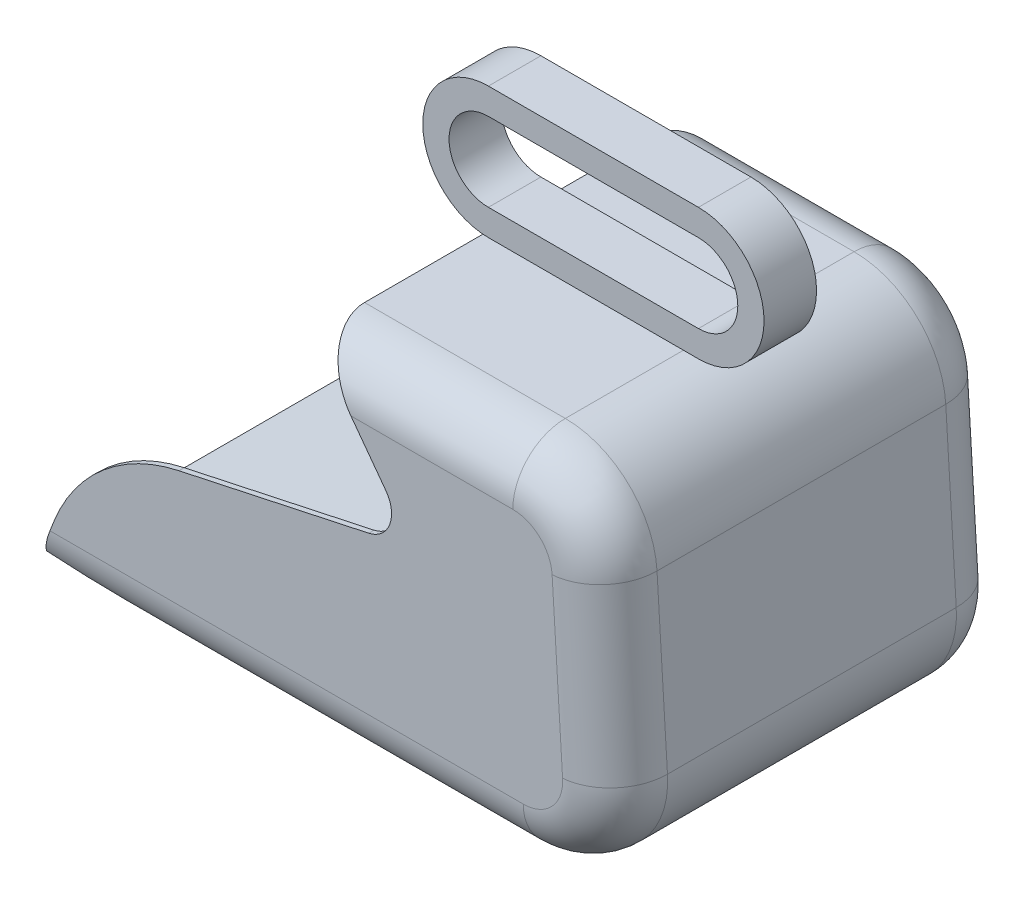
ISO-10303-21;
HEADER;
FILE_DESCRIPTION(('STEP AP214'),'2;1');
FILE_NAME('part.step','',(''),(''),'','','');
FILE_SCHEMA(('AUTOMOTIVE_DESIGN { 1 0 10303 214 1 1 1 1 }'));
ENDSEC;
DATA;
#1=APPLICATION_CONTEXT('core data for automotive mechanical design processes');
#2=APPLICATION_PROTOCOL_DEFINITION('international standard','automotive_design',2000,#1);
#3=PRODUCT_CONTEXT('',#1,'mechanical');
#4=PRODUCT('Part','Part','',(#3));
#5=PRODUCT_RELATED_PRODUCT_CATEGORY('part','',(#4));
#6=PRODUCT_DEFINITION_FORMATION('','',#4);
#7=PRODUCT_DEFINITION_CONTEXT('part definition',#1,'design');
#8=PRODUCT_DEFINITION('design','',#6,#7);
#9=PRODUCT_DEFINITION_SHAPE('','',#8);
#10=(LENGTH_UNIT() NAMED_UNIT(*) SI_UNIT(.MILLI.,.METRE.));
#11=(NAMED_UNIT(*) PLANE_ANGLE_UNIT() SI_UNIT($,.RADIAN.));
#12=(NAMED_UNIT(*) SI_UNIT($,.STERADIAN.) SOLID_ANGLE_UNIT());
#13=UNCERTAINTY_MEASURE_WITH_UNIT(LENGTH_MEASURE(1.E-05),#10,'distance_accuracy_value','');
#14=(GEOMETRIC_REPRESENTATION_CONTEXT(3) GLOBAL_UNCERTAINTY_ASSIGNED_CONTEXT((#13)) GLOBAL_UNIT_ASSIGNED_CONTEXT((#10,
#11,#12)) REPRESENTATION_CONTEXT('',''));
#15=CARTESIAN_POINT('',(0.,0.,0.));
#16=DIRECTION('',(0.,0.,1.));
#17=DIRECTION('',(1.,0.,0.));
#18=AXIS2_PLACEMENT_3D('',#15,#16,#17);
#19=CARTESIAN_POINT('',(131.804003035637,194.20417822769,10.));
#20=DIRECTION('',(0.,0.,1.));
#21=DIRECTION('',(1.,0.,0.));
#22=AXIS2_PLACEMENT_3D('',#19,#20,#21);
#23=PLANE('',#22);
#24=CARTESIAN_POINT('',(131.804003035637,194.20417822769,10.));
#25=DIRECTION('',(0.,0.,1.));
#26=DIRECTION('',(1.,0.,0.));
#27=AXIS2_PLACEMENT_3D('',#24,#25,#26);
#28=CIRCLE('',#27,25.);
#29=CARTESIAN_POINT('',(131.804003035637,219.20417822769,10.));
#30=VERTEX_POINT('',#29);
#31=CARTESIAN_POINT('',(131.804003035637,169.20417822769,10.));
#32=VERTEX_POINT('',#31);
#33=EDGE_CURVE('E149',#30,#32,#28,.T.);
#34=ORIENTED_EDGE('',*,*,#33,.T.);
#35=DIRECTION('',(1.,0.,0.));
#36=VECTOR('',#35,1.);
#37=CARTESIAN_POINT('',(131.804003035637,169.20417822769,10.));
#38=LINE('',#37,#36);
#39=CARTESIAN_POINT('',(211.804003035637,169.20417822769,10.));
#40=VERTEX_POINT('',#39);
#41=EDGE_CURVE('E151',#32,#40,#38,.T.);
#42=ORIENTED_EDGE('',*,*,#41,.T.);
#43=CARTESIAN_POINT('',(211.804003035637,194.20417822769,10.));
#44=DIRECTION('',(0.,0.,1.));
#45=DIRECTION('',(1.,0.,0.));
#46=AXIS2_PLACEMENT_3D('',#43,#44,#45);
#47=CIRCLE('',#46,25.);
#48=CARTESIAN_POINT('',(211.804003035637,219.20417822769,10.));
#49=VERTEX_POINT('',#48);
#50=EDGE_CURVE('E157',#40,#49,#47,.T.);
#51=ORIENTED_EDGE('',*,*,#50,.T.);
#52=DIRECTION('',(-1.,0.,0.));
#53=VECTOR('',#52,1.);
#54=CARTESIAN_POINT('',(131.804003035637,219.20417822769,10.));
#55=LINE('',#54,#53);
#56=EDGE_CURVE('E159',#49,#30,#55,.T.);
#57=ORIENTED_EDGE('',*,*,#56,.T.);
#58=EDGE_LOOP('',(#34,#42,#51,#57));
#59=FACE_BOUND('',#58,.T.);
#60=DIRECTION('',(1.,0.,0.));
#61=VECTOR('',#60,1.);
#62=CARTESIAN_POINT('',(131.804003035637,179.20417822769,10.));
#63=LINE('',#62,#61);
#64=CARTESIAN_POINT('',(131.804003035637,179.20417822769,10.));
#65=VERTEX_POINT('',#64);
#66=CARTESIAN_POINT('',(211.804003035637,179.20417822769,10.));
#67=VERTEX_POINT('',#66);
#68=EDGE_CURVE('E125',#65,#67,#63,.T.);
#69=ORIENTED_EDGE('',*,*,#68,.F.);
#70=CARTESIAN_POINT('',(131.804003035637,194.20417822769,10.));
#71=DIRECTION('',(0.,0.,1.));
#72=DIRECTION('',(1.,0.,0.));
#73=AXIS2_PLACEMENT_3D('',#70,#71,#72);
#74=CIRCLE('',#73,15.);
#75=CARTESIAN_POINT('',(131.804003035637,209.20417822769,10.));
#76=VERTEX_POINT('',#75);
#77=EDGE_CURVE('E112',#76,#65,#74,.T.);
#78=ORIENTED_EDGE('',*,*,#77,.F.);
#79=DIRECTION('',(-1.,0.,0.));
#80=VECTOR('',#79,1.);
#81=CARTESIAN_POINT('',(131.804003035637,209.20417822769,10.));
#82=LINE('',#81,#80);
#83=CARTESIAN_POINT('',(211.804003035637,209.20417822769,10.));
#84=VERTEX_POINT('',#83);
#85=EDGE_CURVE('E137',#84,#76,#82,.T.);
#86=ORIENTED_EDGE('',*,*,#85,.F.);
#87=CARTESIAN_POINT('',(211.804003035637,194.20417822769,10.));
#88=DIRECTION('',(0.,0.,1.));
#89=DIRECTION('',(1.,0.,0.));
#90=AXIS2_PLACEMENT_3D('',#87,#88,#89);
#91=CIRCLE('',#90,15.);
#92=EDGE_CURVE('E134',#67,#84,#91,.T.);
#93=ORIENTED_EDGE('',*,*,#92,.F.);
#94=EDGE_LOOP('',(#69,#78,#86,#93));
#95=FACE_BOUND('',#94,.T.);
#96=ADVANCED_FACE('F47',(#59,#95),#23,.T.);
#97=CARTESIAN_POINT('',(131.804003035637,194.20417822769,-10.));
#98=DIRECTION('',(0.,0.,1.));
#99=DIRECTION('',(1.,0.,0.));
#100=AXIS2_PLACEMENT_3D('',#97,#98,#99);
#101=PLANE('',#100);
#102=CARTESIAN_POINT('',(131.804003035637,194.20417822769,-10.));
#103=DIRECTION('',(0.,0.,1.));
#104=DIRECTION('',(1.,0.,0.));
#105=AXIS2_PLACEMENT_3D('',#102,#103,#104);
#106=CIRCLE('',#105,25.);
#107=CARTESIAN_POINT('',(131.804003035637,219.20417822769,-10.));
#108=VERTEX_POINT('',#107);
#109=CARTESIAN_POINT('',(131.804003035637,169.20417822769,-10.));
#110=VERTEX_POINT('',#109);
#111=EDGE_CURVE('E129',#108,#110,#106,.T.);
#112=ORIENTED_EDGE('',*,*,#111,.F.);
#113=DIRECTION('',(-1.,0.,0.));
#114=VECTOR('',#113,1.);
#115=CARTESIAN_POINT('',(131.804003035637,219.20417822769,-10.));
#116=LINE('',#115,#114);
#117=CARTESIAN_POINT('',(211.804003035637,219.20417822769,-10.));
#118=VERTEX_POINT('',#117);
#119=EDGE_CURVE('E154',#118,#108,#116,.T.);
#120=ORIENTED_EDGE('',*,*,#119,.F.);
#121=CARTESIAN_POINT('',(211.804003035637,194.20417822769,-10.));
#122=DIRECTION('',(0.,0.,1.));
#123=DIRECTION('',(1.,0.,0.));
#124=AXIS2_PLACEMENT_3D('',#121,#122,#123);
#125=CIRCLE('',#124,25.);
#126=CARTESIAN_POINT('',(211.804003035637,169.20417822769,-10.));
#127=VERTEX_POINT('',#126);
#128=EDGE_CURVE('E164',#127,#118,#125,.T.);
#129=ORIENTED_EDGE('',*,*,#128,.F.);
#130=DIRECTION('',(1.,0.,0.));
#131=VECTOR('',#130,1.);
#132=CARTESIAN_POINT('',(131.804003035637,169.20417822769,-10.));
#133=LINE('',#132,#131);
#134=EDGE_CURVE('E161',#110,#127,#133,.T.);
#135=ORIENTED_EDGE('',*,*,#134,.F.);
#136=EDGE_LOOP('',(#112,#120,#129,#135));
#137=FACE_BOUND('',#136,.T.);
#138=CARTESIAN_POINT('',(131.804003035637,194.20417822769,-10.));
#139=DIRECTION('',(0.,0.,1.));
#140=DIRECTION('',(1.,0.,0.));
#141=AXIS2_PLACEMENT_3D('',#138,#139,#140);
#142=CIRCLE('',#141,15.);
#143=CARTESIAN_POINT('',(131.804003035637,209.20417822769,-10.));
#144=VERTEX_POINT('',#143);
#145=CARTESIAN_POINT('',(131.804003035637,179.20417822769,-10.));
#146=VERTEX_POINT('',#145);
#147=EDGE_CURVE('E75',#144,#146,#142,.T.);
#148=ORIENTED_EDGE('',*,*,#147,.T.);
#149=DIRECTION('',(1.,0.,0.));
#150=VECTOR('',#149,1.);
#151=CARTESIAN_POINT('',(131.804003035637,179.20417822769,-10.));
#152=LINE('',#151,#150);
#153=CARTESIAN_POINT('',(211.804003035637,179.20417822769,-10.));
#154=VERTEX_POINT('',#153);
#155=EDGE_CURVE('E128',#146,#154,#152,.T.);
#156=ORIENTED_EDGE('',*,*,#155,.T.);
#157=CARTESIAN_POINT('',(211.804003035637,194.20417822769,-10.));
#158=DIRECTION('',(0.,0.,1.));
#159=DIRECTION('',(1.,0.,0.));
#160=AXIS2_PLACEMENT_3D('',#157,#158,#159);
#161=CIRCLE('',#160,15.);
#162=CARTESIAN_POINT('',(211.804003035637,209.20417822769,-10.));
#163=VERTEX_POINT('',#162);
#164=EDGE_CURVE('E145',#154,#163,#161,.T.);
#165=ORIENTED_EDGE('',*,*,#164,.T.);
#166=DIRECTION('',(-1.,0.,0.));
#167=VECTOR('',#166,1.);
#168=CARTESIAN_POINT('',(131.804003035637,209.20417822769,-10.));
#169=LINE('',#168,#167);
#170=EDGE_CURVE('E124',#163,#144,#169,.T.);
#171=ORIENTED_EDGE('',*,*,#170,.T.);
#172=EDGE_LOOP('',(#148,#156,#165,#171));
#173=FACE_BOUND('',#172,.T.);
#174=ADVANCED_FACE('F182',(#137,#173),#101,.F.);
#175=CARTESIAN_POINT('',(131.804003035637,194.20417822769,10.));
#176=DIRECTION('',(0.,0.,-1.));
#177=DIRECTION('',(-1.,0.,0.));
#178=AXIS2_PLACEMENT_3D('',#175,#176,#177);
#179=CYLINDRICAL_SURFACE('',#178,25.);
#180=ORIENTED_EDGE('',*,*,#111,.T.);
#181=DIRECTION('',(0.,0.,-1.));
#182=VECTOR('',#181,1.);
#183=CARTESIAN_POINT('',(131.804003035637,169.20417822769,10.));
#184=LINE('',#183,#182);
#185=EDGE_CURVE('E12',#32,#110,#184,.T.);
#186=ORIENTED_EDGE('',*,*,#185,.F.);
#187=ORIENTED_EDGE('',*,*,#33,.F.);
#188=DIRECTION('',(0.,0.,-1.));
#189=VECTOR('',#188,1.);
#190=CARTESIAN_POINT('',(131.804003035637,219.20417822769,10.));
#191=LINE('',#190,#189);
#192=EDGE_CURVE('E158',#30,#108,#191,.T.);
#193=ORIENTED_EDGE('',*,*,#192,.T.);
#194=EDGE_LOOP('',(#180,#186,#187,#193));
#195=FACE_BOUND('',#194,.T.);
#196=ADVANCED_FACE('F51',(#195),#179,.T.);
#197=CARTESIAN_POINT('',(131.804003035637,169.20417822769,10.));
#198=DIRECTION('',(0.,1.,0.));
#199=DIRECTION('',(0.,0.,1.));
#200=AXIS2_PLACEMENT_3D('',#197,#198,#199);
#201=PLANE('',#200);
#202=ORIENTED_EDGE('',*,*,#134,.T.);
#203=DIRECTION('',(0.,0.,-1.));
#204=VECTOR('',#203,1.);
#205=CARTESIAN_POINT('',(211.804003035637,169.20417822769,10.));
#206=LINE('',#205,#204);
#207=EDGE_CURVE('E60',#40,#127,#206,.T.);
#208=ORIENTED_EDGE('',*,*,#207,.F.);
#209=ORIENTED_EDGE('',*,*,#41,.F.);
#210=ORIENTED_EDGE('',*,*,#185,.T.);
#211=EDGE_LOOP('',(#202,#208,#209,#210));
#212=FACE_BOUND('',#211,.T.);
#213=ADVANCED_FACE('F192',(#212),#201,.F.);
#214=CARTESIAN_POINT('',(211.804003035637,194.20417822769,10.));
#215=DIRECTION('',(0.,0.,-1.));
#216=DIRECTION('',(-1.,0.,0.));
#217=AXIS2_PLACEMENT_3D('',#214,#215,#216);
#218=CYLINDRICAL_SURFACE('',#217,25.);
#219=ORIENTED_EDGE('',*,*,#128,.T.);
#220=DIRECTION('',(0.,0.,-1.));
#221=VECTOR('',#220,1.);
#222=CARTESIAN_POINT('',(211.804003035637,219.20417822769,10.));
#223=LINE('',#222,#221);
#224=EDGE_CURVE('E167',#49,#118,#223,.T.);
#225=ORIENTED_EDGE('',*,*,#224,.F.);
#226=ORIENTED_EDGE('',*,*,#50,.F.);
#227=ORIENTED_EDGE('',*,*,#207,.T.);
#228=EDGE_LOOP('',(#219,#225,#226,#227));
#229=FACE_BOUND('',#228,.T.);
#230=ADVANCED_FACE('F180',(#229),#218,.T.);
#231=CARTESIAN_POINT('',(131.804003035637,219.20417822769,10.));
#232=DIRECTION('',(0.,-1.,0.));
#233=DIRECTION('',(0.,0.,-1.));
#234=AXIS2_PLACEMENT_3D('',#231,#232,#233);
#235=PLANE('',#234);
#236=ORIENTED_EDGE('',*,*,#119,.T.);
#237=ORIENTED_EDGE('',*,*,#192,.F.);
#238=ORIENTED_EDGE('',*,*,#56,.F.);
#239=ORIENTED_EDGE('',*,*,#224,.T.);
#240=EDGE_LOOP('',(#236,#237,#238,#239));
#241=FACE_BOUND('',#240,.T.);
#242=ADVANCED_FACE('F190',(#241),#235,.F.);
#243=CARTESIAN_POINT('',(131.804003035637,194.20417822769,10.));
#244=DIRECTION('',(0.,0.,-1.));
#245=DIRECTION('',(-1.,0.,0.));
#246=AXIS2_PLACEMENT_3D('',#243,#244,#245);
#247=CYLINDRICAL_SURFACE('',#246,15.);
#248=ORIENTED_EDGE('',*,*,#147,.F.);
#249=DIRECTION('',(0.,0.,-1.));
#250=VECTOR('',#249,1.);
#251=CARTESIAN_POINT('',(131.804003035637,209.20417822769,10.));
#252=LINE('',#251,#250);
#253=EDGE_CURVE('E117',#76,#144,#252,.T.);
#254=ORIENTED_EDGE('',*,*,#253,.F.);
#255=ORIENTED_EDGE('',*,*,#77,.T.);
#256=DIRECTION('',(0.,0.,-1.));
#257=VECTOR('',#256,1.);
#258=CARTESIAN_POINT('',(131.804003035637,179.20417822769,10.));
#259=LINE('',#258,#257);
#260=EDGE_CURVE('E120',#65,#146,#259,.T.);
#261=ORIENTED_EDGE('',*,*,#260,.T.);
#262=EDGE_LOOP('',(#248,#254,#255,#261));
#263=FACE_BOUND('',#262,.T.);
#264=ADVANCED_FACE('F116',(#263),#247,.F.);
#265=CARTESIAN_POINT('',(131.804003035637,179.20417822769,10.));
#266=DIRECTION('',(0.,1.,0.));
#267=DIRECTION('',(0.,0.,1.));
#268=AXIS2_PLACEMENT_3D('',#265,#266,#267);
#269=PLANE('',#268);
#270=ORIENTED_EDGE('',*,*,#155,.F.);
#271=ORIENTED_EDGE('',*,*,#260,.F.);
#272=ORIENTED_EDGE('',*,*,#68,.T.);
#273=DIRECTION('',(0.,0.,-1.));
#274=VECTOR('',#273,1.);
#275=CARTESIAN_POINT('',(211.804003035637,179.20417822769,10.));
#276=LINE('',#275,#274);
#277=EDGE_CURVE('E133',#67,#154,#276,.T.);
#278=ORIENTED_EDGE('',*,*,#277,.T.);
#279=EDGE_LOOP('',(#270,#271,#272,#278));
#280=FACE_BOUND('',#279,.T.);
#281=ADVANCED_FACE('F126',(#280),#269,.T.);
#282=CARTESIAN_POINT('',(211.804003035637,194.20417822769,10.));
#283=DIRECTION('',(0.,0.,-1.));
#284=DIRECTION('',(-1.,0.,0.));
#285=AXIS2_PLACEMENT_3D('',#282,#283,#284);
#286=CYLINDRICAL_SURFACE('',#285,15.);
#287=ORIENTED_EDGE('',*,*,#164,.F.);
#288=ORIENTED_EDGE('',*,*,#277,.F.);
#289=ORIENTED_EDGE('',*,*,#92,.T.);
#290=DIRECTION('',(0.,0.,-1.));
#291=VECTOR('',#290,1.);
#292=CARTESIAN_POINT('',(211.804003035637,209.20417822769,10.));
#293=LINE('',#292,#291);
#294=EDGE_CURVE('E63',#84,#163,#293,.T.);
#295=ORIENTED_EDGE('',*,*,#294,.T.);
#296=EDGE_LOOP('',(#287,#288,#289,#295));
#297=FACE_BOUND('',#296,.T.);
#298=ADVANCED_FACE('F218',(#297),#286,.F.);
#299=CARTESIAN_POINT('',(131.804003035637,209.20417822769,10.));
#300=DIRECTION('',(0.,-1.,0.));
#301=DIRECTION('',(0.,0.,-1.));
#302=AXIS2_PLACEMENT_3D('',#299,#300,#301);
#303=PLANE('',#302);
#304=ORIENTED_EDGE('',*,*,#170,.F.);
#305=ORIENTED_EDGE('',*,*,#294,.F.);
#306=ORIENTED_EDGE('',*,*,#85,.T.);
#307=ORIENTED_EDGE('',*,*,#253,.T.);
#308=EDGE_LOOP('',(#304,#305,#306,#307));
#309=FACE_BOUND('',#308,.T.);
#310=ADVANCED_FACE('F217',(#309),#303,.T.);
#311=CLOSED_SHELL('',(#96,#174,#196,#213,#230,#242,#264,#281,#298,#310));
#312=MANIFOLD_SOLID_BREP('B2',#311);
#313=CARTESIAN_POINT('',(129.607473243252,169.20417822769,75.));
#314=DIRECTION('',(0.803601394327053,0.595167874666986,0.));
#315=DIRECTION('',(-0.595167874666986,0.803601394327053,0.));
#316=AXIS2_PLACEMENT_3D('',#313,#314,#315);
#317=PLANE('',#316);
#318=DIRECTION('',(0.,0.,-1.));
#319=VECTOR('',#318,1.);
#320=CARTESIAN_POINT('',(129.607473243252,169.20417822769,75.));
#321=LINE('',#320,#319);
#322=CARTESIAN_POINT('',(129.607473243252,169.20417822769,55.));
#323=VERTEX_POINT('',#322);
#324=CARTESIAN_POINT('',(129.607473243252,169.20417822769,-55.));
#325=VERTEX_POINT('',#324);
#326=EDGE_CURVE('E532',#323,#325,#321,.T.);
#327=ORIENTED_EDGE('',*,*,#326,.T.);
#328=CARTESIAN_POINT('',(144.419987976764,149.20417822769,-55.));
#329=DIRECTION('',(0.803601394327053,0.595167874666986,0.));
#330=DIRECTION('',(-0.595167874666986,0.803601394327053,0.));
#331=AXIS2_PLACEMENT_3D('',#328,#329,#330);
#332=ELLIPSE('',#331,24.8879607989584,20.);
#333=CARTESIAN_POINT('',(144.419987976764,149.20417822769,-75.));
#334=VERTEX_POINT('',#333);
#335=EDGE_CURVE('E50',#325,#334,#332,.F.);
#336=ORIENTED_EDGE('',*,*,#335,.T.);
#337=DIRECTION('',(0.595167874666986,-0.803601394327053,0.));
#338=VECTOR('',#337,1.);
#339=CARTESIAN_POINT('',(129.607473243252,169.20417822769,-75.));
#340=LINE('',#339,#338);
#341=CARTESIAN_POINT('',(157.751251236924,131.20417822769,-75.));
#342=VERTEX_POINT('',#341);
#343=EDGE_CURVE('E527',#334,#342,#340,.T.);
#344=ORIENTED_EDGE('',*,*,#343,.T.);
#345=DIRECTION('',(0.,0.,-1.));
#346=VECTOR('',#345,1.);
#347=CARTESIAN_POINT('',(157.751251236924,131.20417822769,75.));
#348=LINE('',#347,#346);
#349=CARTESIAN_POINT('',(157.751251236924,131.20417822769,-73.));
#350=VERTEX_POINT('',#349);
#351=EDGE_CURVE('E518',#350,#342,#348,.T.);
#352=ORIENTED_EDGE('',*,*,#351,.F.);
#353=DIRECTION('',(0.595167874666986,-0.803601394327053,0.));
#354=VECTOR('',#353,1.);
#355=CARTESIAN_POINT('',(129.607473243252,169.20417822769,-73.));
#356=LINE('',#355,#354);
#357=CARTESIAN_POINT('',(145.901239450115,147.20417822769,-73.));
#358=VERTEX_POINT('',#357);
#359=EDGE_CURVE('E501',#358,#350,#356,.T.);
#360=ORIENTED_EDGE('',*,*,#359,.F.);
#361=CARTESIAN_POINT('',(145.901239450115,147.20417822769,-53.));
#362=DIRECTION('',(0.803601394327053,0.595167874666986,0.));
#363=DIRECTION('',(0.595167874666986,-0.803601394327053,0.));
#364=AXIS2_PLACEMENT_3D('',#361,#362,#363);
#365=ELLIPSE('',#364,24.8879607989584,20.);
#366=CARTESIAN_POINT('',(131.088724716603,167.20417822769,-53.));
#367=VERTEX_POINT('',#366);
#368=EDGE_CURVE('E641',#358,#367,#365,.T.);
#369=ORIENTED_EDGE('',*,*,#368,.T.);
#370=DIRECTION('',(0.,0.,-1.));
#371=VECTOR('',#370,1.);
#372=CARTESIAN_POINT('',(131.088724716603,167.20417822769,75.));
#373=LINE('',#372,#371);
#374=CARTESIAN_POINT('',(131.088724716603,167.20417822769,53.));
#375=VERTEX_POINT('',#374);
#376=EDGE_CURVE('E897',#375,#367,#373,.T.);
#377=ORIENTED_EDGE('',*,*,#376,.F.);
#378=CARTESIAN_POINT('',(145.901239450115,147.20417822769,53.));
#379=DIRECTION('',(0.803601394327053,0.595167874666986,0.));
#380=DIRECTION('',(-0.595167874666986,0.803601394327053,0.));
#381=AXIS2_PLACEMENT_3D('',#378,#379,#380);
#382=ELLIPSE('',#381,24.8879607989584,20.);
#383=CARTESIAN_POINT('',(145.901239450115,147.20417822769,73.));
#384=VERTEX_POINT('',#383);
#385=EDGE_CURVE('E645',#375,#384,#382,.T.);
#386=ORIENTED_EDGE('',*,*,#385,.T.);
#387=DIRECTION('',(0.595167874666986,-0.803601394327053,0.));
#388=VECTOR('',#387,1.);
#389=CARTESIAN_POINT('',(129.607473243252,169.20417822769,73.));
#390=LINE('',#389,#388);
#391=CARTESIAN_POINT('',(157.751251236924,131.20417822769,73.));
#392=VERTEX_POINT('',#391);
#393=EDGE_CURVE('E879',#384,#392,#390,.T.);
#394=ORIENTED_EDGE('',*,*,#393,.T.);
#395=CARTESIAN_POINT('',(157.751251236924,131.20417822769,75.));
#396=VERTEX_POINT('',#395);
#397=EDGE_CURVE('E530',#396,#392,#348,.T.);
#398=ORIENTED_EDGE('',*,*,#397,.F.);
#399=DIRECTION('',(0.595167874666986,-0.803601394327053,0.));
#400=VECTOR('',#399,1.);
#401=CARTESIAN_POINT('',(129.607473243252,169.20417822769,75.));
#402=LINE('',#401,#400);
#403=CARTESIAN_POINT('',(144.419987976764,149.20417822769,75.));
#404=VERTEX_POINT('',#403);
#405=EDGE_CURVE('E782',#404,#396,#402,.T.);
#406=ORIENTED_EDGE('',*,*,#405,.F.);
#407=CARTESIAN_POINT('',(144.419987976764,149.20417822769,55.));
#408=DIRECTION('',(0.803601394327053,0.595167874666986,0.));
#409=DIRECTION('',(0.595167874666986,-0.803601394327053,0.));
#410=AXIS2_PLACEMENT_3D('',#407,#408,#409);
#411=ELLIPSE('',#410,24.8879607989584,20.);
#412=EDGE_CURVE('E290',#404,#323,#411,.F.);
#413=ORIENTED_EDGE('',*,*,#412,.T.);
#414=EDGE_LOOP('',(#327,#336,#344,#352,#360,#369,#377,#386,#394,#398,#406,#413));
#415=FACE_BOUND('',#414,.T.);
#416=ADVANCED_FACE('F277',(#415),#317,.F.);
#417=CARTESIAN_POINT('',(148.911635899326,124.657331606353,75.));
#418=DIRECTION('',(0.,0.,-1.));
#419=DIRECTION('',(-1.,0.,0.));
#420=AXIS2_PLACEMENT_3D('',#417,#418,#419);
#421=CYLINDRICAL_SURFACE('',#420,11.);
#422=CARTESIAN_POINT('',(148.911635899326,124.657331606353,-73.));
#423=DIRECTION('',(0.,0.,1.));
#424=DIRECTION('',(1.,0.,0.));
#425=AXIS2_PLACEMENT_3D('',#422,#423,#424);
#426=CIRCLE('',#425,11.);
#427=CARTESIAN_POINT('',(151.222930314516,113.902894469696,-73.));
#428=VERTEX_POINT('',#427);
#429=EDGE_CURVE('E504',#350,#428,#426,.F.);
#430=ORIENTED_EDGE('',*,*,#429,.F.);
#431=ORIENTED_EDGE('',*,*,#351,.T.);
#432=CARTESIAN_POINT('',(148.911635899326,124.657331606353,-75.));
#433=DIRECTION('',(0.,0.,-1.));
#434=DIRECTION('',(1.,0.,0.));
#435=AXIS2_PLACEMENT_3D('',#432,#433,#434);
#436=CIRCLE('',#435,11.);
#437=CARTESIAN_POINT('',(151.222930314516,113.902894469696,-75.));
#438=VERTEX_POINT('',#437);
#439=EDGE_CURVE('E862',#342,#438,#436,.T.);
#440=ORIENTED_EDGE('',*,*,#439,.T.);
#441=DIRECTION('',(0.,0.,-1.));
#442=VECTOR('',#441,1.);
#443=CARTESIAN_POINT('',(151.222930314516,113.902894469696,75.));
#444=LINE('',#443,#442);
#445=EDGE_CURVE('E523',#428,#438,#444,.T.);
#446=ORIENTED_EDGE('',*,*,#445,.F.);
#447=EDGE_LOOP('',(#430,#431,#440,#446));
#448=FACE_BOUND('',#447,.T.);
#449=ADVANCED_FACE('F520',(#448),#421,.F.);
#450=CARTESIAN_POINT('',(151.222930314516,113.902894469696,75.));
#451=DIRECTION('',(0.210117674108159,-0.977676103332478,0.));
#452=DIRECTION('',(0.977676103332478,0.210117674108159,0.));
#453=AXIS2_PLACEMENT_3D('',#450,#451,#452);
#454=PLANE('',#453);
#455=DIRECTION('',(-0.977676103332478,-0.210117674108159,0.));
#456=VECTOR('',#455,1.);
#457=CARTESIAN_POINT('',(151.222930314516,113.902894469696,-73.));
#458=LINE('',#457,#456);
#459=CARTESIAN_POINT('',(78.9185056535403,98.3635583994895,-73.));
#460=VERTEX_POINT('',#459);
#461=EDGE_CURVE('E525',#428,#460,#458,.T.);
#462=ORIENTED_EDGE('',*,*,#461,.F.);
#463=ORIENTED_EDGE('',*,*,#445,.T.);
#464=DIRECTION('',(-0.977676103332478,-0.210117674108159,0.));
#465=VECTOR('',#464,1.);
#466=CARTESIAN_POINT('',(151.222930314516,113.902894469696,-75.));
#467=LINE('',#466,#465);
#468=CARTESIAN_POINT('',(78.9185056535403,98.3635583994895,-75.));
#469=VERTEX_POINT('',#468);
#470=EDGE_CURVE('E858',#438,#469,#467,.T.);
#471=ORIENTED_EDGE('',*,*,#470,.T.);
#472=DIRECTION('',(0.,0.,-1.));
#473=VECTOR('',#472,1.);
#474=CARTESIAN_POINT('',(78.9185056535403,98.3635583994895,75.));
#475=LINE('',#474,#473);
#476=EDGE_CURVE('E838',#460,#469,#475,.T.);
#477=ORIENTED_EDGE('',*,*,#476,.F.);
#478=EDGE_LOOP('',(#462,#463,#471,#477));
#479=FACE_BOUND('',#478,.T.);
#480=ADVANCED_FACE('F861',(#479),#454,.F.);
#481=CARTESIAN_POINT('',(92.7862721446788,33.836935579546,75.));
#482=DIRECTION('',(0.,0.,-1.));
#483=DIRECTION('',(-1.,0.,0.));
#484=AXIS2_PLACEMENT_3D('',#481,#482,#483);
#485=CYLINDRICAL_SURFACE('',#484,66.);
#486=CARTESIAN_POINT('',(92.7862721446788,33.836935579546,-73.));
#487=DIRECTION('',(0.,0.,1.));
#488=DIRECTION('',(1.,0.,0.));
#489=AXIS2_PLACEMENT_3D('',#486,#487,#488);
#490=CIRCLE('',#489,66.);
#491=CARTESIAN_POINT('',(31.4021120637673,58.0853353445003,-73.));
#492=VERTEX_POINT('',#491);
#493=EDGE_CURVE('E860',#460,#492,#490,.T.);
#494=ORIENTED_EDGE('',*,*,#493,.F.);
#495=ORIENTED_EDGE('',*,*,#476,.T.);
#496=CARTESIAN_POINT('',(92.7862721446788,33.836935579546,-75.));
#497=DIRECTION('',(0.,0.,1.));
#498=DIRECTION('',(1.,0.,0.));
#499=AXIS2_PLACEMENT_3D('',#496,#497,#498);
#500=CIRCLE('',#499,66.);
#501=CARTESIAN_POINT('',(31.4021120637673,58.0853353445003,-75.));
#502=VERTEX_POINT('',#501);
#503=EDGE_CURVE('E853',#469,#502,#500,.T.);
#504=ORIENTED_EDGE('',*,*,#503,.T.);
#505=DIRECTION('',(0.,0.,-1.));
#506=VECTOR('',#505,1.);
#507=CARTESIAN_POINT('',(31.4021120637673,58.0853353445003,75.));
#508=LINE('',#507,#506);
#509=EDGE_CURVE('E835',#492,#502,#508,.T.);
#510=ORIENTED_EDGE('',*,*,#509,.F.);
#511=EDGE_LOOP('',(#494,#495,#504,#510));
#512=FACE_BOUND('',#511,.T.);
#513=ADVANCED_FACE('F855',(#512),#485,.T.);
#514=CARTESIAN_POINT('',(31.4021120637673,58.0853353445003,75.));
#515=DIRECTION('',(0.930063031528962,-0.367399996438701,0.));
#516=DIRECTION('',(0.367399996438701,0.930063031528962,0.));
#517=AXIS2_PLACEMENT_3D('',#514,#515,#516);
#518=PLANE('',#517);
#519=DIRECTION('',(0.,0.,-1.));
#520=VECTOR('',#519,1.);
#521=CARTESIAN_POINT('',(25.8911121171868,44.1343898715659,75.));
#522=LINE('',#521,#520);
#523=CARTESIAN_POINT('',(25.8911121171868,44.1343898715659,72.4165582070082));
#524=VERTEX_POINT('',#523);
#525=CARTESIAN_POINT('',(25.8911121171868,44.1343898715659,-72.4165582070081));
#526=VERTEX_POINT('',#525);
#527=EDGE_CURVE('E823',#524,#526,#522,.T.);
#528=ORIENTED_EDGE('',*,*,#527,.F.);
#529=CARTESIAN_POINT('',(29.7749225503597,53.9661496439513,55.));
#530=DIRECTION('',(0.930063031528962,-0.367399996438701,0.));
#531=DIRECTION('',(-0.367399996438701,-0.930063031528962,0.));
#532=AXIS2_PLACEMENT_3D('',#529,#530,#531);
#533=ELLIPSE('',#532,21.5039188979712,20.);
#534=CARTESIAN_POINT('',(29.7749225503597,53.9661496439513,75.));
#535=VERTEX_POINT('',#534);
#536=EDGE_CURVE('E571',#524,#535,#533,.F.);
#537=ORIENTED_EDGE('',*,*,#536,.T.);
#538=DIRECTION('',(-0.367399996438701,-0.930063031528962,0.));
#539=VECTOR('',#538,1.);
#540=CARTESIAN_POINT('',(31.4021120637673,58.0853353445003,75.));
#541=LINE('',#540,#539);
#542=CARTESIAN_POINT('',(31.4021120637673,58.0853353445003,75.));
#543=VERTEX_POINT('',#542);
#544=EDGE_CURVE('E837',#543,#535,#541,.T.);
#545=ORIENTED_EDGE('',*,*,#544,.F.);
#546=CARTESIAN_POINT('',(31.4021120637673,58.0853353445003,73.));
#547=VERTEX_POINT('',#546);
#548=EDGE_CURVE('E833',#543,#547,#508,.T.);
#549=ORIENTED_EDGE('',*,*,#548,.T.);
#550=DIRECTION('',(-0.367399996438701,-0.930063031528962,0.));
#551=VECTOR('',#550,1.);
#552=CARTESIAN_POINT('',(31.4021120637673,58.0853353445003,73.));
#553=LINE('',#552,#551);
#554=CARTESIAN_POINT('',(30.564976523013,55.9661496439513,73.));
#555=VERTEX_POINT('',#554);
#556=EDGE_CURVE('E891',#547,#555,#553,.T.);
#557=ORIENTED_EDGE('',*,*,#556,.T.);
#558=CARTESIAN_POINT('',(30.564976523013,55.9661496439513,53.));
#559=DIRECTION('',(0.930063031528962,-0.367399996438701,0.));
#560=DIRECTION('',(0.367399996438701,0.930063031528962,0.));
#561=AXIS2_PLACEMENT_3D('',#558,#559,#560);
#562=ELLIPSE('',#561,21.5039188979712,20.);
#563=CARTESIAN_POINT('',(26.643914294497,46.0400879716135,70.3629864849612));
#564=VERTEX_POINT('',#563);
#565=EDGE_CURVE('E646',#555,#564,#562,.T.);
#566=ORIENTED_EDGE('',*,*,#565,.T.);
#567=DIRECTION('',(0.,0.,-1.));
#568=VECTOR('',#567,1.);
#569=CARTESIAN_POINT('',(26.643914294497,46.0400879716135,75.));
#570=LINE('',#569,#568);
#571=CARTESIAN_POINT('',(26.643914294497,46.0400879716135,-70.3629864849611));
#572=VERTEX_POINT('',#571);
#573=EDGE_CURVE('E894',#564,#572,#570,.T.);
#574=ORIENTED_EDGE('',*,*,#573,.T.);
#575=CARTESIAN_POINT('',(30.564976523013,55.9661496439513,-53.));
#576=DIRECTION('',(0.930063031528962,-0.367399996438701,0.));
#577=DIRECTION('',(-0.367399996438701,-0.930063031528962,0.));
#578=AXIS2_PLACEMENT_3D('',#575,#576,#577);
#579=ELLIPSE('',#578,21.5039188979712,20.);
#580=CARTESIAN_POINT('',(30.564976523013,55.9661496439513,-73.));
#581=VERTEX_POINT('',#580);
#582=EDGE_CURVE('E647',#572,#581,#579,.T.);
#583=ORIENTED_EDGE('',*,*,#582,.T.);
#584=DIRECTION('',(-0.367399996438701,-0.930063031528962,0.));
#585=VECTOR('',#584,1.);
#586=CARTESIAN_POINT('',(31.4021120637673,58.0853353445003,-73.));
#587=LINE('',#586,#585);
#588=EDGE_CURVE('E881',#492,#581,#587,.T.);
#589=ORIENTED_EDGE('',*,*,#588,.F.);
#590=ORIENTED_EDGE('',*,*,#509,.T.);
#591=DIRECTION('',(-0.367399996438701,-0.930063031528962,0.));
#592=VECTOR('',#591,1.);
#593=CARTESIAN_POINT('',(31.4021120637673,58.0853353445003,-75.));
#594=LINE('',#593,#592);
#595=CARTESIAN_POINT('',(29.7749225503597,53.9661496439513,-75.));
#596=VERTEX_POINT('',#595);
#597=EDGE_CURVE('E868',#502,#596,#594,.T.);
#598=ORIENTED_EDGE('',*,*,#597,.T.);
#599=CARTESIAN_POINT('',(29.7749225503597,53.9661496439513,-55.));
#600=DIRECTION('',(0.930063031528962,-0.367399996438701,0.));
#601=DIRECTION('',(0.367399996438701,0.930063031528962,0.));
#602=AXIS2_PLACEMENT_3D('',#599,#600,#601);
#603=ELLIPSE('',#602,21.5039188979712,20.);
#604=EDGE_CURVE('E567',#596,#526,#603,.F.);
#605=ORIENTED_EDGE('',*,*,#604,.T.);
#606=EDGE_LOOP('',(#528,#537,#545,#549,#557,#566,#574,#583,#589,#590,#598,#605));
#607=FACE_BOUND('',#606,.T.);
#608=ADVANCED_FACE('F830',(#607),#518,.F.);
#609=CARTESIAN_POINT('',(90.0908542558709,33.9661496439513,75.));
#610=DIRECTION('',(0.,1.,0.));
#611=DIRECTION('',(0.,0.,1.));
#612=AXIS2_PLACEMENT_3D('',#609,#610,#611);
#613=PLANE('',#612);
#614=DIRECTION('',(0.,0.,-1.));
#615=VECTOR('',#614,1.);
#616=CARTESIAN_POINT('',(210.090854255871,33.9661496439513,75.));
#617=LINE('',#616,#615);
#618=CARTESIAN_POINT('',(210.090854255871,33.9661496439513,55.));
#619=VERTEX_POINT('',#618);
#620=CARTESIAN_POINT('',(210.090854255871,33.9661496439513,-55.));
#621=VERTEX_POINT('',#620);
#622=EDGE_CURVE('E547',#619,#621,#617,.T.);
#623=ORIENTED_EDGE('',*,*,#622,.F.);
#624=DIRECTION('',(1.,0.,0.));
#625=VECTOR('',#624,1.);
#626=CARTESIAN_POINT('',(90.0908542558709,33.9661496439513,55.));
#627=LINE('',#626,#625);
#628=CARTESIAN_POINT('',(90.0908542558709,33.9661496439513,55.));
#629=VERTEX_POINT('',#628);
#630=EDGE_CURVE('E563',#619,#629,#627,.F.);
#631=ORIENTED_EDGE('',*,*,#630,.T.);
#632=DIRECTION('',(0.,0.,-1.));
#633=VECTOR('',#632,1.);
#634=CARTESIAN_POINT('',(90.0908542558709,33.9661496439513,75.));
#635=LINE('',#634,#633);
#636=CARTESIAN_POINT('',(90.0908542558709,33.9661496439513,-55.));
#637=VERTEX_POINT('',#636);
#638=EDGE_CURVE('E824',#629,#637,#635,.T.);
#639=ORIENTED_EDGE('',*,*,#638,.T.);
#640=DIRECTION('',(1.,0.,0.));
#641=VECTOR('',#640,1.);
#642=CARTESIAN_POINT('',(90.0908542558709,33.9661496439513,-55.));
#643=LINE('',#642,#641);
#644=EDGE_CURVE('E557',#637,#621,#643,.T.);
#645=ORIENTED_EDGE('',*,*,#644,.T.);
#646=EDGE_LOOP('',(#623,#631,#639,#645));
#647=FACE_BOUND('',#646,.T.);
#648=ADVANCED_FACE('F813',(#647),#613,.F.);
#649=CARTESIAN_POINT('',(210.090854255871,68.9661496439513,75.));
#650=DIRECTION('',(0.,0.,-1.));
#651=DIRECTION('',(-1.,0.,0.));
#652=AXIS2_PLACEMENT_3D('',#649,#650,#651);
#653=CYLINDRICAL_SURFACE('',#652,35.);
#654=DIRECTION('',(0.,0.,-1.));
#655=VECTOR('',#654,1.);
#656=CARTESIAN_POINT('',(245.014080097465,71.2831081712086,75.));
#657=LINE('',#656,#655);
#658=CARTESIAN_POINT('',(245.014080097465,71.2831081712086,55.));
#659=VERTEX_POINT('',#658);
#660=CARTESIAN_POINT('',(245.014080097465,71.2831081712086,-55.));
#661=VERTEX_POINT('',#660);
#662=EDGE_CURVE('E541',#659,#661,#657,.T.);
#663=ORIENTED_EDGE('',*,*,#662,.F.);
#664=CARTESIAN_POINT('',(210.090854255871,68.9661496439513,55.));
#665=DIRECTION('',(0.,0.,1.));
#666=DIRECTION('',(1.,0.,0.));
#667=AXIS2_PLACEMENT_3D('',#664,#665,#666);
#668=CIRCLE('',#667,35.);
#669=EDGE_CURVE('E574',#659,#619,#668,.F.);
#670=ORIENTED_EDGE('',*,*,#669,.T.);
#671=ORIENTED_EDGE('',*,*,#622,.T.);
#672=CARTESIAN_POINT('',(210.090854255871,68.9661496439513,-55.));
#673=DIRECTION('',(0.,0.,1.));
#674=DIRECTION('',(1.,0.,0.));
#675=AXIS2_PLACEMENT_3D('',#672,#673,#674);
#676=CIRCLE('',#675,35.);
#677=EDGE_CURVE('E572',#621,#661,#676,.T.);
#678=ORIENTED_EDGE('',*,*,#677,.T.);
#679=EDGE_LOOP('',(#663,#670,#671,#678));
#680=FACE_BOUND('',#679,.T.);
#681=ADVANCED_FACE('F809',(#680),#653,.T.);
#682=CARTESIAN_POINT('',(245.014080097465,71.2831081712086,75.));
#683=DIRECTION('',(-0.998134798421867,-0.0610485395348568,0.));
#684=DIRECTION('',(0.0610485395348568,-0.998134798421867,0.));
#685=AXIS2_PLACEMENT_3D('',#682,#683,#684);
#686=PLANE('',#685);
#687=DIRECTION('',(0.,0.,-1.));
#688=VECTOR('',#687,1.);
#689=CARTESIAN_POINT('',(241.034976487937,136.34087711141,75.));
#690=LINE('',#689,#688);
#691=CARTESIAN_POINT('',(241.034976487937,136.34087711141,55.));
#692=VERTEX_POINT('',#691);
#693=CARTESIAN_POINT('',(241.034976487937,136.34087711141,-55.));
#694=VERTEX_POINT('',#693);
#695=EDGE_CURVE('E539',#692,#694,#690,.T.);
#696=ORIENTED_EDGE('',*,*,#695,.F.);
#697=DIRECTION('',(-0.0610485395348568,0.998134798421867,0.));
#698=VECTOR('',#697,1.);
#699=CARTESIAN_POINT('',(245.014080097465,71.2831081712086,55.));
#700=LINE('',#699,#698);
#701=EDGE_CURVE('E576',#692,#659,#700,.F.);
#702=ORIENTED_EDGE('',*,*,#701,.T.);
#703=ORIENTED_EDGE('',*,*,#662,.T.);
#704=DIRECTION('',(-0.0610485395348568,0.998134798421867,0.));
#705=VECTOR('',#704,1.);
#706=CARTESIAN_POINT('',(245.014080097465,71.2831081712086,-55.));
#707=LINE('',#706,#705);
#708=EDGE_CURVE('E580',#661,#694,#707,.T.);
#709=ORIENTED_EDGE('',*,*,#708,.T.);
#710=EDGE_LOOP('',(#696,#702,#703,#709));
#711=FACE_BOUND('',#710,.T.);
#712=ADVANCED_FACE('F793',(#711),#686,.F.);
#713=CARTESIAN_POINT('',(206.100258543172,134.20417822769,75.));
#714=DIRECTION('',(0.,0.,-1.));
#715=DIRECTION('',(-1.,0.,0.));
#716=AXIS2_PLACEMENT_3D('',#713,#714,#715);
#717=CYLINDRICAL_SURFACE('',#716,35.);
#718=DIRECTION('',(0.,0.,-1.));
#719=VECTOR('',#718,1.);
#720=CARTESIAN_POINT('',(206.100258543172,169.20417822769,75.));
#721=LINE('',#720,#719);
#722=CARTESIAN_POINT('',(206.100258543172,169.20417822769,55.));
#723=VERTEX_POINT('',#722);
#724=CARTESIAN_POINT('',(206.100258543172,169.20417822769,-55.));
#725=VERTEX_POINT('',#724);
#726=EDGE_CURVE('E540',#723,#725,#721,.T.);
#727=ORIENTED_EDGE('',*,*,#726,.F.);
#728=CARTESIAN_POINT('',(206.100258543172,134.20417822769,55.));
#729=DIRECTION('',(0.,0.,1.));
#730=DIRECTION('',(1.,0.,0.));
#731=AXIS2_PLACEMENT_3D('',#728,#729,#730);
#732=CIRCLE('',#731,35.);
#733=EDGE_CURVE('E582',#723,#692,#732,.F.);
#734=ORIENTED_EDGE('',*,*,#733,.T.);
#735=ORIENTED_EDGE('',*,*,#695,.T.);
#736=CARTESIAN_POINT('',(206.100258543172,134.20417822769,-55.));
#737=DIRECTION('',(0.,0.,1.));
#738=DIRECTION('',(1.,0.,0.));
#739=AXIS2_PLACEMENT_3D('',#736,#737,#738);
#740=CIRCLE('',#739,35.);
#741=EDGE_CURVE('E581',#694,#725,#740,.T.);
#742=ORIENTED_EDGE('',*,*,#741,.T.);
#743=EDGE_LOOP('',(#727,#734,#735,#742));
#744=FACE_BOUND('',#743,.T.);
#745=ADVANCED_FACE('F792',(#744),#717,.T.);
#746=CARTESIAN_POINT('',(206.100258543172,169.20417822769,75.));
#747=DIRECTION('',(0.,-1.,0.));
#748=DIRECTION('',(0.,0.,-1.));
#749=AXIS2_PLACEMENT_3D('',#746,#747,#748);
#750=PLANE('',#749);
#751=ORIENTED_EDGE('',*,*,#726,.T.);
#752=DIRECTION('',(-1.,0.,0.));
#753=VECTOR('',#752,1.);
#754=CARTESIAN_POINT('',(206.100258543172,169.20417822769,-55.));
#755=LINE('',#754,#753);
#756=EDGE_CURVE('E632',#725,#325,#755,.T.);
#757=ORIENTED_EDGE('',*,*,#756,.T.);
#758=ORIENTED_EDGE('',*,*,#326,.F.);
#759=DIRECTION('',(-1.,0.,0.));
#760=VECTOR('',#759,1.);
#761=CARTESIAN_POINT('',(206.100258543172,169.20417822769,55.));
#762=LINE('',#761,#760);
#763=EDGE_CURVE('E635',#323,#723,#762,.F.);
#764=ORIENTED_EDGE('',*,*,#763,.T.);
#765=EDGE_LOOP('',(#751,#757,#758,#764));
#766=FACE_BOUND('',#765,.T.);
#767=ADVANCED_FACE('F778',(#766),#750,.F.);
#768=ORIENTED_EDGE('',*,*,#397,.T.);
#769=CARTESIAN_POINT('',(148.911635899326,124.657331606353,73.));
#770=DIRECTION('',(0.,0.,1.));
#771=DIRECTION('',(1.,0.,0.));
#772=AXIS2_PLACEMENT_3D('',#769,#770,#771);
#773=CIRCLE('',#772,11.);
#774=CARTESIAN_POINT('',(151.222930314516,113.902894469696,73.));
#775=VERTEX_POINT('',#774);
#776=EDGE_CURVE('E885',#392,#775,#773,.F.);
#777=ORIENTED_EDGE('',*,*,#776,.T.);
#778=CARTESIAN_POINT('',(151.222930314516,113.902894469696,75.));
#779=VERTEX_POINT('',#778);
#780=EDGE_CURVE('E529',#779,#775,#444,.T.);
#781=ORIENTED_EDGE('',*,*,#780,.F.);
#782=CARTESIAN_POINT('',(148.911635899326,124.657331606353,75.));
#783=DIRECTION('',(0.,0.,-1.));
#784=DIRECTION('',(1.,0.,0.));
#785=AXIS2_PLACEMENT_3D('',#782,#783,#784);
#786=CIRCLE('',#785,11.);
#787=EDGE_CURVE('E877',#396,#779,#786,.T.);
#788=ORIENTED_EDGE('',*,*,#787,.F.);
#789=EDGE_LOOP('',(#768,#777,#781,#788));
#790=FACE_BOUND('',#789,.T.);
#791=ADVANCED_FACE('F966',(#790),#421,.F.);
#792=ORIENTED_EDGE('',*,*,#780,.T.);
#793=DIRECTION('',(-0.977676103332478,-0.210117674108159,0.));
#794=VECTOR('',#793,1.);
#795=CARTESIAN_POINT('',(151.222930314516,113.902894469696,73.));
#796=LINE('',#795,#794);
#797=CARTESIAN_POINT('',(78.9185056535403,98.3635583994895,73.));
#798=VERTEX_POINT('',#797);
#799=EDGE_CURVE('E886',#775,#798,#796,.T.);
#800=ORIENTED_EDGE('',*,*,#799,.T.);
#801=CARTESIAN_POINT('',(78.9185056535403,98.3635583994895,75.));
#802=VERTEX_POINT('',#801);
#803=EDGE_CURVE('E841',#802,#798,#475,.T.);
#804=ORIENTED_EDGE('',*,*,#803,.F.);
#805=DIRECTION('',(-0.977676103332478,-0.210117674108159,0.));
#806=VECTOR('',#805,1.);
#807=CARTESIAN_POINT('',(151.222930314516,113.902894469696,75.));
#808=LINE('',#807,#806);
#809=EDGE_CURVE('E873',#779,#802,#808,.T.);
#810=ORIENTED_EDGE('',*,*,#809,.F.);
#811=EDGE_LOOP('',(#792,#800,#804,#810));
#812=FACE_BOUND('',#811,.T.);
#813=ADVANCED_FACE('F963',(#812),#454,.F.);
#814=ORIENTED_EDGE('',*,*,#803,.T.);
#815=CARTESIAN_POINT('',(92.7862721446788,33.836935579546,73.));
#816=DIRECTION('',(0.,0.,1.));
#817=DIRECTION('',(1.,0.,0.));
#818=AXIS2_PLACEMENT_3D('',#815,#816,#817);
#819=CIRCLE('',#818,66.);
#820=EDGE_CURVE('E887',#798,#547,#819,.T.);
#821=ORIENTED_EDGE('',*,*,#820,.T.);
#822=ORIENTED_EDGE('',*,*,#548,.F.);
#823=CARTESIAN_POINT('',(92.7862721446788,33.836935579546,75.));
#824=DIRECTION('',(0.,0.,1.));
#825=DIRECTION('',(1.,0.,0.));
#826=AXIS2_PLACEMENT_3D('',#823,#824,#825);
#827=CIRCLE('',#826,66.);
#828=EDGE_CURVE('E874',#802,#543,#827,.T.);
#829=ORIENTED_EDGE('',*,*,#828,.F.);
#830=EDGE_LOOP('',(#814,#821,#822,#829));
#831=FACE_BOUND('',#830,.T.);
#832=ADVANCED_FACE('F961',(#831),#485,.T.);
#833=CARTESIAN_POINT('',(25.8911121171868,44.1343898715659,75.));
#834=DIRECTION('',(0.156434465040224,0.987688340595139,0.));
#835=DIRECTION('',(-0.987688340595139,0.156434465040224,0.));
#836=AXIS2_PLACEMENT_3D('',#833,#834,#835);
#837=PLANE('',#836);
#838=ORIENTED_EDGE('',*,*,#638,.F.);
#839=CARTESIAN_POINT('',(-36.1841760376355,53.9661496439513,55.));
#840=DIRECTION('',(0.156434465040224,0.987688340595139,0.));
#841=DIRECTION('',(-0.987688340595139,0.156434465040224,0.));
#842=AXIS2_PLACEMENT_3D('',#839,#840,#841);
#843=ELLIPSE('',#842,127.849064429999,20.);
#844=EDGE_CURVE('E570',#629,#524,#843,.F.);
#845=ORIENTED_EDGE('',*,*,#844,.T.);
#846=ORIENTED_EDGE('',*,*,#527,.T.);
#847=CARTESIAN_POINT('',(-36.1841760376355,53.9661496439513,-55.));
#848=DIRECTION('',(0.156434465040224,0.987688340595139,0.));
#849=DIRECTION('',(0.987688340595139,-0.156434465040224,0.));
#850=AXIS2_PLACEMENT_3D('',#847,#848,#849);
#851=ELLIPSE('',#850,127.849064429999,20.);
#852=EDGE_CURVE('E564',#526,#637,#851,.F.);
#853=ORIENTED_EDGE('',*,*,#852,.T.);
#854=EDGE_LOOP('',(#838,#845,#846,#853));
#855=FACE_BOUND('',#854,.T.);
#856=ADVANCED_FACE('F825',(#855),#837,.F.);
#857=CARTESIAN_POINT('',(210.090854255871,68.9661496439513,75.));
#858=DIRECTION('',(0.,0.,1.));
#859=DIRECTION('',(1.,0.,0.));
#860=AXIS2_PLACEMENT_3D('',#857,#858,#859);
#861=PLANE('',#860);
#862=ORIENTED_EDGE('',*,*,#544,.T.);
#863=DIRECTION('',(1.,0.,0.));
#864=VECTOR('',#863,1.);
#865=CARTESIAN_POINT('',(210.090854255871,53.9661496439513,75.));
#866=LINE('',#865,#864);
#867=CARTESIAN_POINT('',(210.090854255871,53.9661496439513,75.));
#868=VERTEX_POINT('',#867);
#869=EDGE_CURVE('E560',#535,#868,#866,.T.);
#870=ORIENTED_EDGE('',*,*,#869,.T.);
#871=CARTESIAN_POINT('',(210.090854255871,68.9661496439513,75.));
#872=DIRECTION('',(0.,0.,1.));
#873=DIRECTION('',(1.,0.,0.));
#874=AXIS2_PLACEMENT_3D('',#871,#872,#873);
#875=CIRCLE('',#874,15.);
#876=CARTESIAN_POINT('',(225.055192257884,69.9998750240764,75.));
#877=VERTEX_POINT('',#876);
#878=EDGE_CURVE('E554',#868,#877,#875,.T.);
#879=ORIENTED_EDGE('',*,*,#878,.T.);
#880=DIRECTION('',(-0.0610485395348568,0.998134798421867,0.));
#881=VECTOR('',#880,1.);
#882=CARTESIAN_POINT('',(221.0722805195,135.119906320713,75.));
#883=LINE('',#882,#881);
#884=CARTESIAN_POINT('',(221.0722805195,135.119906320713,75.));
#885=VERTEX_POINT('',#884);
#886=EDGE_CURVE('E551',#877,#885,#883,.T.);
#887=ORIENTED_EDGE('',*,*,#886,.T.);
#888=CARTESIAN_POINT('',(206.100258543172,134.20417822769,75.));
#889=DIRECTION('',(0.,0.,1.));
#890=DIRECTION('',(1.,0.,0.));
#891=AXIS2_PLACEMENT_3D('',#888,#889,#890);
#892=CIRCLE('',#891,15.);
#893=CARTESIAN_POINT('',(206.100258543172,149.20417822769,75.));
#894=VERTEX_POINT('',#893);
#895=EDGE_CURVE('E553',#885,#894,#892,.T.);
#896=ORIENTED_EDGE('',*,*,#895,.T.);
#897=DIRECTION('',(-1.,0.,0.));
#898=VECTOR('',#897,1.);
#899=CARTESIAN_POINT('',(129.607473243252,149.20417822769,75.));
#900=LINE('',#899,#898);
#901=EDGE_CURVE('E546',#894,#404,#900,.T.);
#902=ORIENTED_EDGE('',*,*,#901,.T.);
#903=ORIENTED_EDGE('',*,*,#405,.T.);
#904=ORIENTED_EDGE('',*,*,#787,.T.);
#905=ORIENTED_EDGE('',*,*,#809,.T.);
#906=ORIENTED_EDGE('',*,*,#828,.T.);
#907=EDGE_LOOP('',(#862,#870,#879,#887,#896,#902,#903,#904,#905,#906));
#908=FACE_BOUND('',#907,.T.);
#909=ADVANCED_FACE('F1218',(#908),#861,.T.);
#910=CARTESIAN_POINT('',(210.090854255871,68.9661496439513,-75.));
#911=DIRECTION('',(0.,0.,1.));
#912=DIRECTION('',(1.,0.,0.));
#913=AXIS2_PLACEMENT_3D('',#910,#911,#912);
#914=PLANE('',#913);
#915=CARTESIAN_POINT('',(210.090854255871,68.9661496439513,-75.));
#916=DIRECTION('',(0.,0.,1.));
#917=DIRECTION('',(1.,0.,0.));
#918=AXIS2_PLACEMENT_3D('',#915,#916,#917);
#919=CIRCLE('',#918,15.);
#920=CARTESIAN_POINT('',(225.055192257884,69.9998750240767,-75.));
#921=VERTEX_POINT('',#920);
#922=CARTESIAN_POINT('',(210.090854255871,53.9661496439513,-75.));
#923=VERTEX_POINT('',#922);
#924=EDGE_CURVE('E624',#921,#923,#919,.F.);
#925=ORIENTED_EDGE('',*,*,#924,.T.);
#926=DIRECTION('',(1.,0.,0.));
#927=VECTOR('',#926,1.);
#928=CARTESIAN_POINT('',(210.090854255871,53.9661496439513,-75.));
#929=LINE('',#928,#927);
#930=EDGE_CURVE('E629',#923,#596,#929,.F.);
#931=ORIENTED_EDGE('',*,*,#930,.T.);
#932=ORIENTED_EDGE('',*,*,#597,.F.);
#933=ORIENTED_EDGE('',*,*,#503,.F.);
#934=ORIENTED_EDGE('',*,*,#470,.F.);
#935=ORIENTED_EDGE('',*,*,#439,.F.);
#936=ORIENTED_EDGE('',*,*,#343,.F.);
#937=DIRECTION('',(-1.,0.,0.));
#938=VECTOR('',#937,1.);
#939=CARTESIAN_POINT('',(210.090854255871,149.20417822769,-75.));
#940=LINE('',#939,#938);
#941=CARTESIAN_POINT('',(206.100258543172,149.20417822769,-75.));
#942=VERTEX_POINT('',#941);
#943=EDGE_CURVE('E628',#334,#942,#940,.F.);
#944=ORIENTED_EDGE('',*,*,#943,.T.);
#945=CARTESIAN_POINT('',(206.100258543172,134.20417822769,-75.));
#946=DIRECTION('',(0.,0.,1.));
#947=DIRECTION('',(1.,0.,0.));
#948=AXIS2_PLACEMENT_3D('',#945,#946,#947);
#949=CIRCLE('',#948,15.);
#950=CARTESIAN_POINT('',(221.0722805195,135.119906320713,-75.));
#951=VERTEX_POINT('',#950);
#952=EDGE_CURVE('E626',#942,#951,#949,.F.);
#953=ORIENTED_EDGE('',*,*,#952,.T.);
#954=DIRECTION('',(-0.0610485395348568,0.998134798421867,0.));
#955=VECTOR('',#954,1.);
#956=CARTESIAN_POINT('',(225.062411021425,69.8818492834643,-75.));
#957=LINE('',#956,#955);
#958=EDGE_CURVE('E625',#951,#921,#957,.F.);
#959=ORIENTED_EDGE('',*,*,#958,.T.);
#960=EDGE_LOOP('',(#925,#931,#932,#933,#934,#935,#936,#944,#953,#959));
#961=FACE_BOUND('',#960,.T.);
#962=ADVANCED_FACE('F864',(#961),#914,.F.);
#963=CARTESIAN_POINT('',(90.0908542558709,35.9661496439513,75.));
#964=DIRECTION('',(0.,1.,0.));
#965=DIRECTION('',(0.,0.,1.));
#966=AXIS2_PLACEMENT_3D('',#963,#964,#965);
#967=PLANE('',#966);
#968=DIRECTION('',(0.,0.,-1.));
#969=VECTOR('',#968,1.);
#970=CARTESIAN_POINT('',(90.2482576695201,35.9661496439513,75.));
#971=LINE('',#970,#969);
#972=CARTESIAN_POINT('',(90.2482576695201,35.9661496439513,53.));
#973=VERTEX_POINT('',#972);
#974=CARTESIAN_POINT('',(90.2482576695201,35.9661496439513,-53.));
#975=VERTEX_POINT('',#974);
#976=EDGE_CURVE('E892',#973,#975,#971,.T.);
#977=ORIENTED_EDGE('',*,*,#976,.F.);
#978=DIRECTION('',(1.,0.,0.));
#979=VECTOR('',#978,1.);
#980=CARTESIAN_POINT('',(90.0908542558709,35.9661496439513,53.));
#981=LINE('',#980,#979);
#982=CARTESIAN_POINT('',(210.090854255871,35.9661496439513,53.));
#983=VERTEX_POINT('',#982);
#984=EDGE_CURVE('E640',#973,#983,#981,.T.);
#985=ORIENTED_EDGE('',*,*,#984,.T.);
#986=DIRECTION('',(0.,0.,-1.));
#987=VECTOR('',#986,1.);
#988=CARTESIAN_POINT('',(210.090854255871,35.9661496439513,75.));
#989=LINE('',#988,#987);
#990=CARTESIAN_POINT('',(210.090854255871,35.9661496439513,-53.));
#991=VERTEX_POINT('',#990);
#992=EDGE_CURVE('E872',#983,#991,#989,.T.);
#993=ORIENTED_EDGE('',*,*,#992,.T.);
#994=DIRECTION('',(1.,0.,0.));
#995=VECTOR('',#994,1.);
#996=CARTESIAN_POINT('',(90.2482576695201,35.9661496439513,-53.));
#997=LINE('',#996,#995);
#998=EDGE_CURVE('E294',#991,#975,#997,.F.);
#999=ORIENTED_EDGE('',*,*,#998,.T.);
#1000=EDGE_LOOP('',(#977,#985,#993,#999));
#1001=FACE_BOUND('',#1000,.T.);
#1002=ADVANCED_FACE('F912',(#1001),#967,.T.);
#1003=CARTESIAN_POINT('',(210.090854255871,68.9661496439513,75.));
#1004=DIRECTION('',(0.,0.,-1.));
#1005=DIRECTION('',(-1.,0.,0.));
#1006=AXIS2_PLACEMENT_3D('',#1003,#1004,#1005);
#1007=CYLINDRICAL_SURFACE('',#1006,33.);
#1008=DIRECTION('',(0.,0.,-1.));
#1009=VECTOR('',#1008,1.);
#1010=CARTESIAN_POINT('',(243.018130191,71.1557842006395,73.));
#1011=LINE('',#1010,#1009);
#1012=CARTESIAN_POINT('',(243.018130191,71.1557842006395,53.));
#1013=VERTEX_POINT('',#1012);
#1014=CARTESIAN_POINT('',(243.018130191,71.1557842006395,-53.));
#1015=VERTEX_POINT('',#1014);
#1016=EDGE_CURVE('E909',#1013,#1015,#1011,.T.);
#1017=ORIENTED_EDGE('',*,*,#1016,.T.);
#1018=CARTESIAN_POINT('',(210.090854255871,68.9661496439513,-53.));
#1019=DIRECTION('',(0.,0.,1.));
#1020=DIRECTION('',(1.,0.,0.));
#1021=AXIS2_PLACEMENT_3D('',#1018,#1019,#1020);
#1022=CIRCLE('',#1021,33.);
#1023=EDGE_CURVE('E619',#1015,#991,#1022,.F.);
#1024=ORIENTED_EDGE('',*,*,#1023,.T.);
#1025=ORIENTED_EDGE('',*,*,#992,.F.);
#1026=CARTESIAN_POINT('',(210.090854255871,68.9661496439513,53.));
#1027=DIRECTION('',(0.,0.,1.));
#1028=DIRECTION('',(1.,0.,0.));
#1029=AXIS2_PLACEMENT_3D('',#1026,#1027,#1028);
#1030=CIRCLE('',#1029,33.);
#1031=EDGE_CURVE('E616',#983,#1013,#1030,.T.);
#1032=ORIENTED_EDGE('',*,*,#1031,.T.);
#1033=EDGE_LOOP('',(#1017,#1024,#1025,#1032));
#1034=FACE_BOUND('',#1033,.T.);
#1035=ADVANCED_FACE('F1170',(#1034),#1007,.F.);
#1036=CARTESIAN_POINT('',(243.017810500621,71.1610110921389,75.));
#1037=DIRECTION('',(-0.998134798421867,-0.0610485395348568,0.));
#1038=DIRECTION('',(0.0610485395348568,-0.998134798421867,0.));
#1039=AXIS2_PLACEMENT_3D('',#1036,#1037,#1038);
#1040=PLANE('',#1039);
#1041=ORIENTED_EDGE('',*,*,#1016,.F.);
#1042=DIRECTION('',(-0.0610485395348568,0.998134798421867,0.));
#1043=VECTOR('',#1042,1.);
#1044=CARTESIAN_POINT('',(243.017810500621,71.1610110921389,53.));
#1045=LINE('',#1044,#1043);
#1046=CARTESIAN_POINT('',(239.038706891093,136.21878003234,53.));
#1047=VERTEX_POINT('',#1046);
#1048=EDGE_CURVE('E608',#1013,#1047,#1045,.T.);
#1049=ORIENTED_EDGE('',*,*,#1048,.T.);
#1050=DIRECTION('',(0.,0.,-1.));
#1051=VECTOR('',#1050,1.);
#1052=CARTESIAN_POINT('',(239.038706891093,136.21878003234,75.));
#1053=LINE('',#1052,#1051);
#1054=CARTESIAN_POINT('',(239.038706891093,136.21878003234,-53.));
#1055=VERTEX_POINT('',#1054);
#1056=EDGE_CURVE('E910',#1047,#1055,#1053,.T.);
#1057=ORIENTED_EDGE('',*,*,#1056,.T.);
#1058=DIRECTION('',(-0.0610485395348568,0.998134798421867,0.));
#1059=VECTOR('',#1058,1.);
#1060=CARTESIAN_POINT('',(243.018130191,71.1557842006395,-53.));
#1061=LINE('',#1060,#1059);
#1062=EDGE_CURVE('E603',#1055,#1015,#1061,.F.);
#1063=ORIENTED_EDGE('',*,*,#1062,.T.);
#1064=EDGE_LOOP('',(#1041,#1049,#1057,#1063));
#1065=FACE_BOUND('',#1064,.T.);
#1066=ADVANCED_FACE('F977',(#1065),#1040,.T.);
#1067=CARTESIAN_POINT('',(206.100258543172,134.20417822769,75.));
#1068=DIRECTION('',(0.,0.,-1.));
#1069=DIRECTION('',(-1.,0.,0.));
#1070=AXIS2_PLACEMENT_3D('',#1067,#1068,#1069);
#1071=CYLINDRICAL_SURFACE('',#1070,33.);
#1072=ORIENTED_EDGE('',*,*,#1056,.F.);
#1073=CARTESIAN_POINT('',(206.100258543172,134.20417822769,53.));
#1074=DIRECTION('',(0.,0.,1.));
#1075=DIRECTION('',(1.,0.,0.));
#1076=AXIS2_PLACEMENT_3D('',#1073,#1074,#1075);
#1077=CIRCLE('',#1076,33.);
#1078=CARTESIAN_POINT('',(206.100258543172,167.20417822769,53.));
#1079=VERTEX_POINT('',#1078);
#1080=EDGE_CURVE('E605',#1047,#1079,#1077,.T.);
#1081=ORIENTED_EDGE('',*,*,#1080,.T.);
#1082=DIRECTION('',(0.,0.,-1.));
#1083=VECTOR('',#1082,1.);
#1084=CARTESIAN_POINT('',(206.100258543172,167.20417822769,75.));
#1085=LINE('',#1084,#1083);
#1086=CARTESIAN_POINT('',(206.100258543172,167.20417822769,-53.));
#1087=VERTEX_POINT('',#1086);
#1088=EDGE_CURVE('E901',#1079,#1087,#1085,.T.);
#1089=ORIENTED_EDGE('',*,*,#1088,.T.);
#1090=CARTESIAN_POINT('',(206.100258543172,134.20417822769,-53.));
#1091=DIRECTION('',(0.,0.,1.));
#1092=DIRECTION('',(1.,0.,0.));
#1093=AXIS2_PLACEMENT_3D('',#1090,#1091,#1092);
#1094=CIRCLE('',#1093,33.);
#1095=EDGE_CURVE('E598',#1087,#1055,#1094,.F.);
#1096=ORIENTED_EDGE('',*,*,#1095,.T.);
#1097=EDGE_LOOP('',(#1072,#1081,#1089,#1096));
#1098=FACE_BOUND('',#1097,.T.);
#1099=ADVANCED_FACE('F980',(#1098),#1071,.F.);
#1100=CARTESIAN_POINT('',(206.100258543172,167.20417822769,75.));
#1101=DIRECTION('',(0.,-1.,0.));
#1102=DIRECTION('',(0.,0.,-1.));
#1103=AXIS2_PLACEMENT_3D('',#1100,#1101,#1102);
#1104=PLANE('',#1103);
#1105=ORIENTED_EDGE('',*,*,#1088,.F.);
#1106=DIRECTION('',(-1.,0.,0.));
#1107=VECTOR('',#1106,1.);
#1108=CARTESIAN_POINT('',(206.100258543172,167.20417822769,53.));
#1109=LINE('',#1108,#1107);
#1110=EDGE_CURVE('E590',#1079,#375,#1109,.T.);
#1111=ORIENTED_EDGE('',*,*,#1110,.T.);
#1112=ORIENTED_EDGE('',*,*,#376,.T.);
#1113=DIRECTION('',(-1.,0.,0.));
#1114=VECTOR('',#1113,1.);
#1115=CARTESIAN_POINT('',(206.100258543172,167.20417822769,-53.));
#1116=LINE('',#1115,#1114);
#1117=EDGE_CURVE('E584',#367,#1087,#1116,.F.);
#1118=ORIENTED_EDGE('',*,*,#1117,.T.);
#1119=EDGE_LOOP('',(#1105,#1111,#1112,#1118));
#1120=FACE_BOUND('',#1119,.T.);
#1121=ADVANCED_FACE('F972',(#1120),#1104,.T.);
#1122=CARTESIAN_POINT('',(26.2039810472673,46.1097665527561,75.));
#1123=DIRECTION('',(0.156434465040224,0.987688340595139,0.));
#1124=DIRECTION('',(-0.987688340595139,0.156434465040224,0.));
#1125=AXIS2_PLACEMENT_3D('',#1122,#1123,#1124);
#1126=PLANE('',#1125);
#1127=ORIENTED_EDGE('',*,*,#573,.F.);
#1128=CARTESIAN_POINT('',(-36.0267726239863,55.9661496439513,53.));
#1129=DIRECTION('',(0.156434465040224,0.987688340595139,0.));
#1130=DIRECTION('',(0.987688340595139,-0.156434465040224,0.));
#1131=AXIS2_PLACEMENT_3D('',#1128,#1129,#1130);
#1132=ELLIPSE('',#1131,127.849064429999,20.);
#1133=EDGE_CURVE('E305',#564,#973,#1132,.T.);
#1134=ORIENTED_EDGE('',*,*,#1133,.T.);
#1135=ORIENTED_EDGE('',*,*,#976,.T.);
#1136=CARTESIAN_POINT('',(-36.0267726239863,55.9661496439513,-53.));
#1137=DIRECTION('',(0.156434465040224,0.987688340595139,0.));
#1138=DIRECTION('',(-0.987688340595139,0.156434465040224,0.));
#1139=AXIS2_PLACEMENT_3D('',#1136,#1137,#1138);
#1140=ELLIPSE('',#1139,127.849064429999,20.);
#1141=EDGE_CURVE('E638',#975,#572,#1140,.T.);
#1142=ORIENTED_EDGE('',*,*,#1141,.T.);
#1143=EDGE_LOOP('',(#1127,#1134,#1135,#1142));
#1144=FACE_BOUND('',#1143,.T.);
#1145=ADVANCED_FACE('F985',(#1144),#1126,.T.);
#1146=CARTESIAN_POINT('',(210.090854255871,68.9661496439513,73.));
#1147=DIRECTION('',(0.,0.,1.));
#1148=DIRECTION('',(1.,0.,0.));
#1149=AXIS2_PLACEMENT_3D('',#1146,#1147,#1148);
#1150=PLANE('',#1149);
#1151=ORIENTED_EDGE('',*,*,#393,.F.);
#1152=DIRECTION('',(-1.,0.,0.));
#1153=VECTOR('',#1152,1.);
#1154=CARTESIAN_POINT('',(210.090854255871,147.20417822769,73.));
#1155=LINE('',#1154,#1153);
#1156=CARTESIAN_POINT('',(206.100258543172,147.20417822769,73.));
#1157=VERTEX_POINT('',#1156);
#1158=EDGE_CURVE('E596',#384,#1157,#1155,.F.);
#1159=ORIENTED_EDGE('',*,*,#1158,.T.);
#1160=CARTESIAN_POINT('',(206.100258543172,134.20417822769,73.));
#1161=DIRECTION('',(0.,0.,1.));
#1162=DIRECTION('',(1.,0.,0.));
#1163=AXIS2_PLACEMENT_3D('',#1160,#1161,#1162);
#1164=CIRCLE('',#1163,13.);
#1165=CARTESIAN_POINT('',(219.076010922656,134.997809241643,73.));
#1166=VERTEX_POINT('',#1165);
#1167=EDGE_CURVE('E597',#1157,#1166,#1164,.F.);
#1168=ORIENTED_EDGE('',*,*,#1167,.T.);
#1169=DIRECTION('',(-0.0610485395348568,0.998134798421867,0.));
#1170=VECTOR('',#1169,1.);
#1171=CARTESIAN_POINT('',(223.066141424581,69.7597522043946,73.));
#1172=LINE('',#1171,#1170);
#1173=CARTESIAN_POINT('',(223.059421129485,69.8696280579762,73.));
#1174=VERTEX_POINT('',#1173);
#1175=EDGE_CURVE('E591',#1166,#1174,#1172,.F.);
#1176=ORIENTED_EDGE('',*,*,#1175,.T.);
#1177=CARTESIAN_POINT('',(210.090854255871,68.9661496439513,73.));
#1178=DIRECTION('',(0.,0.,1.));
#1179=DIRECTION('',(1.,0.,0.));
#1180=AXIS2_PLACEMENT_3D('',#1177,#1178,#1179);
#1181=CIRCLE('',#1180,13.);
#1182=CARTESIAN_POINT('',(210.090854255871,55.9661496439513,73.));
#1183=VERTEX_POINT('',#1182);
#1184=EDGE_CURVE('E587',#1174,#1183,#1181,.F.);
#1185=ORIENTED_EDGE('',*,*,#1184,.T.);
#1186=DIRECTION('',(1.,0.,0.));
#1187=VECTOR('',#1186,1.);
#1188=CARTESIAN_POINT('',(210.090854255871,55.9661496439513,73.));
#1189=LINE('',#1188,#1187);
#1190=EDGE_CURVE('E595',#1183,#555,#1189,.F.);
#1191=ORIENTED_EDGE('',*,*,#1190,.T.);
#1192=ORIENTED_EDGE('',*,*,#556,.F.);
#1193=ORIENTED_EDGE('',*,*,#820,.F.);
#1194=ORIENTED_EDGE('',*,*,#799,.F.);
#1195=ORIENTED_EDGE('',*,*,#776,.F.);
#1196=EDGE_LOOP('',(#1151,#1159,#1168,#1176,#1185,#1191,#1192,#1193,#1194,#1195));
#1197=FACE_BOUND('',#1196,.T.);
#1198=ADVANCED_FACE('F953',(#1197),#1150,.F.);
#1199=CARTESIAN_POINT('',(210.090854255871,68.9661496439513,-73.));
#1200=DIRECTION('',(0.,0.,1.));
#1201=DIRECTION('',(1.,0.,0.));
#1202=AXIS2_PLACEMENT_3D('',#1199,#1200,#1201);
#1203=PLANE('',#1202);
#1204=ORIENTED_EDGE('',*,*,#588,.T.);
#1205=DIRECTION('',(1.,0.,0.));
#1206=VECTOR('',#1205,1.);
#1207=CARTESIAN_POINT('',(210.090854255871,55.9661496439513,-73.));
#1208=LINE('',#1207,#1206);
#1209=CARTESIAN_POINT('',(210.090854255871,55.9661496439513,-73.));
#1210=VERTEX_POINT('',#1209);
#1211=EDGE_CURVE('E618',#581,#1210,#1208,.T.);
#1212=ORIENTED_EDGE('',*,*,#1211,.T.);
#1213=CARTESIAN_POINT('',(210.090854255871,68.9661496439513,-73.));
#1214=DIRECTION('',(0.,0.,1.));
#1215=DIRECTION('',(1.,0.,0.));
#1216=AXIS2_PLACEMENT_3D('',#1213,#1214,#1215);
#1217=CIRCLE('',#1216,13.);
#1218=CARTESIAN_POINT('',(223.059421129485,69.8696280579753,-73.));
#1219=VERTEX_POINT('',#1218);
#1220=EDGE_CURVE('E614',#1210,#1219,#1217,.T.);
#1221=ORIENTED_EDGE('',*,*,#1220,.T.);
#1222=DIRECTION('',(-0.0610485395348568,0.998134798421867,0.));
#1223=VECTOR('',#1222,1.);
#1224=CARTESIAN_POINT('',(219.076010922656,134.997809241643,-73.));
#1225=LINE('',#1224,#1223);
#1226=CARTESIAN_POINT('',(219.076010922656,134.997809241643,-73.));
#1227=VERTEX_POINT('',#1226);
#1228=EDGE_CURVE('E612',#1219,#1227,#1225,.T.);
#1229=ORIENTED_EDGE('',*,*,#1228,.T.);
#1230=CARTESIAN_POINT('',(206.100258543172,134.20417822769,-73.));
#1231=DIRECTION('',(0.,0.,1.));
#1232=DIRECTION('',(1.,0.,0.));
#1233=AXIS2_PLACEMENT_3D('',#1230,#1231,#1232);
#1234=CIRCLE('',#1233,13.);
#1235=CARTESIAN_POINT('',(206.100258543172,147.20417822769,-73.));
#1236=VERTEX_POINT('',#1235);
#1237=EDGE_CURVE('E606',#1227,#1236,#1234,.T.);
#1238=ORIENTED_EDGE('',*,*,#1237,.T.);
#1239=DIRECTION('',(-1.,0.,0.));
#1240=VECTOR('',#1239,1.);
#1241=CARTESIAN_POINT('',(131.088724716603,147.20417822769,-73.));
#1242=LINE('',#1241,#1240);
#1243=EDGE_CURVE('E507',#1236,#358,#1242,.T.);
#1244=ORIENTED_EDGE('',*,*,#1243,.T.);
#1245=ORIENTED_EDGE('',*,*,#359,.T.);
#1246=ORIENTED_EDGE('',*,*,#429,.T.);
#1247=ORIENTED_EDGE('',*,*,#461,.T.);
#1248=ORIENTED_EDGE('',*,*,#493,.T.);
#1249=EDGE_LOOP('',(#1204,#1212,#1221,#1229,#1238,#1244,#1245,#1246,#1247,#1248));
#1250=FACE_BOUND('',#1249,.T.);
#1251=ADVANCED_FACE('F502',(#1250),#1203,.T.);
#1252=CARTESIAN_POINT('',(210.090854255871,149.20417822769,55.));
#1253=DIRECTION('',(1.,0.,0.));
#1254=DIRECTION('',(0.,0.,-1.));
#1255=AXIS2_PLACEMENT_3D('',#1252,#1253,#1254);
#1256=CYLINDRICAL_SURFACE('',#1255,20.);
#1257=ORIENTED_EDGE('',*,*,#412,.F.);
#1258=ORIENTED_EDGE('',*,*,#901,.F.);
#1259=CARTESIAN_POINT('',(206.100258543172,149.20417822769,55.));
#1260=DIRECTION('',(1.,0.,0.));
#1261=DIRECTION('',(0.,0.,-1.));
#1262=AXIS2_PLACEMENT_3D('',#1259,#1260,#1261);
#1263=CIRCLE('',#1262,20.);
#1264=EDGE_CURVE('E515',#723,#894,#1263,.T.);
#1265=ORIENTED_EDGE('',*,*,#1264,.F.);
#1266=ORIENTED_EDGE('',*,*,#763,.F.);
#1267=EDGE_LOOP('',(#1257,#1258,#1265,#1266));
#1268=FACE_BOUND('',#1267,.T.);
#1269=ADVANCED_FACE('F680',(#1268),#1256,.T.);
#1270=CARTESIAN_POINT('',(206.100258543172,134.20417822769,55.));
#1271=DIRECTION('',(0.,0.,1.));
#1272=DIRECTION('',(1.,0.,0.));
#1273=AXIS2_PLACEMENT_3D('',#1270,#1271,#1272);
#1274=DEGENERATE_TOROIDAL_SURFACE('',#1273,15.,20.,.T.);
#1275=ORIENTED_EDGE('',*,*,#1264,.T.);
#1276=ORIENTED_EDGE('',*,*,#895,.F.);
#1277=CARTESIAN_POINT('',(221.0722805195,135.119906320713,55.));
#1278=DIRECTION('',(0.0610485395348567,-0.998134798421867,0.));
#1279=DIRECTION('',(0.998134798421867,0.0610485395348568,0.));
#1280=AXIS2_PLACEMENT_3D('',#1277,#1278,#1279);
#1281=CIRCLE('',#1280,20.);
#1282=EDGE_CURVE('E661',#692,#885,#1281,.T.);
#1283=ORIENTED_EDGE('',*,*,#1282,.F.);
#1284=ORIENTED_EDGE('',*,*,#733,.F.);
#1285=EDGE_LOOP('',(#1275,#1276,#1283,#1284));
#1286=FACE_BOUND('',#1285,.T.);
#1287=ADVANCED_FACE('F674',(#1286),#1274,.T.);
#1288=CARTESIAN_POINT('',(225.062411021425,69.8818492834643,55.));
#1289=DIRECTION('',(0.0610485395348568,-0.998134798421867,0.));
#1290=DIRECTION('',(0.998134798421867,0.0610485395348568,0.));
#1291=AXIS2_PLACEMENT_3D('',#1288,#1289,#1290);
#1292=CYLINDRICAL_SURFACE('',#1291,20.);
#1293=ORIENTED_EDGE('',*,*,#1282,.T.);
#1294=ORIENTED_EDGE('',*,*,#886,.F.);
#1295=CARTESIAN_POINT('',(245.014080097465,71.2831081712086,55.));
#1296=CARTESIAN_POINT('',(245.01408043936,71.2831081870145,55.2812720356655));
#1297=CARTESIAN_POINT('',(245.008157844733,71.2827306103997,55.562512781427));
#1298=CARTESIAN_POINT('',(244.984483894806,71.2812213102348,56.1244872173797));
#1299=CARTESIAN_POINT('',(244.966732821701,71.2800896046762,56.4052209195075));
#1300=CARTESIAN_POINT('',(244.89577435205,71.2755656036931,57.245870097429));
#1301=CARTESIAN_POINT('',(244.824861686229,71.2710444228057,57.8043794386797));
#1302=CARTESIAN_POINT('',(244.636367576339,71.2590253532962,58.9130382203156));
#1303=CARTESIAN_POINT('',(244.518818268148,71.2515295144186,59.4631931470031));
#1304=CARTESIAN_POINT('',(244.308186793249,71.2380960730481,60.2793656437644));
#1305=CARTESIAN_POINT('',(244.232254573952,71.2332530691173,60.5499240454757));
#1306=CARTESIAN_POINT('',(244.069062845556,71.2228437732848,61.087664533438));
#1307=CARTESIAN_POINT('',(243.981800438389,71.2172772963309,61.3548457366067));
#1308=CARTESIAN_POINT('',(243.703206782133,71.1995041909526,62.1506610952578));
#1309=CARTESIAN_POINT('',(243.495087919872,71.1862250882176,62.6734940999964));
#1310=CARTESIAN_POINT('',(243.035616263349,71.1569013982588,63.6997238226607));
#1311=CARTESIAN_POINT('',(242.784263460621,71.1408568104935,64.2031205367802));
#1312=CARTESIAN_POINT('',(242.376248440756,71.1148045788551,64.9408310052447));
#1313=CARTESIAN_POINT('',(242.235070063,71.1057890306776,65.1838506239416));
#1314=CARTESIAN_POINT('',(241.942656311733,71.0871128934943,65.6636492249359));
#1315=CARTESIAN_POINT('',(241.791423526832,71.0774524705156,65.9004297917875));
#1316=CARTESIAN_POINT('',(241.322952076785,71.0475226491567,66.600907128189));
#1317=CARTESIAN_POINT('',(240.990913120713,71.0263029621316,67.0547886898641));
#1318=CARTESIAN_POINT('',(240.289918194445,70.9814867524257,67.932834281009));
#1319=CARTESIAN_POINT('',(239.920964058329,70.9578903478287,68.3569997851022));
#1320=CARTESIAN_POINT('',(239.148717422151,70.9084790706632,69.1726917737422));
#1321=CARTESIAN_POINT('',(238.745424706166,70.8826641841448,69.5642180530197));
#1322=CARTESIAN_POINT('',(237.907160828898,70.8289787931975,70.3120064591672));
#1323=CARTESIAN_POINT('',(237.47217878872,70.8011075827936,70.6682563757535));
#1324=CARTESIAN_POINT('',(236.798556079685,70.757919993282,71.1740370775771));
#1325=CARTESIAN_POINT('',(236.570481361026,70.7432934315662,71.3378705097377));
#1326=CARTESIAN_POINT('',(236.107583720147,70.7135982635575,71.6558018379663));
#1327=CARTESIAN_POINT('',(235.872759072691,70.6985295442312,71.8098972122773));
#1328=CARTESIAN_POINT('',(235.158812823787,70.652700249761,72.2571183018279));
#1329=CARTESIAN_POINT('',(234.670194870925,70.6213149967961,72.5351970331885));
#1330=CARTESIAN_POINT('',(233.671310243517,70.5571044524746,73.0490833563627));
#1331=CARTESIAN_POINT('',(233.161043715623,70.5242791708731,73.2848912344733));
#1332=CARTESIAN_POINT('',(232.382414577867,70.4741461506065,73.605553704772));
#1333=CARTESIAN_POINT('',(232.120721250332,70.4572894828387,73.706915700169));
#1334=CARTESIAN_POINT('',(231.593374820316,70.423305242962,73.898476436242));
#1335=CARTESIAN_POINT('',(231.327722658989,70.4061777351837,73.9886777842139));
#1336=CARTESIAN_POINT('',(230.525518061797,70.3544310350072,74.2422898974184));
#1337=CARTESIAN_POINT('',(229.983503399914,70.3194338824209,74.3887968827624));
#1338=CARTESIAN_POINT('',(229.102868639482,70.2625069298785,74.5873712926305));
#1339=CARTESIAN_POINT('',(228.767408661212,70.240806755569,74.6539824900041));
#1340=CARTESIAN_POINT('',(228.093525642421,70.1971814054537,74.769851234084));
#1341=CARTESIAN_POINT('',(227.755102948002,70.1752562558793,74.8191107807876));
#1342=CARTESIAN_POINT('',(227.076664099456,70.1312659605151,74.9000881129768));
#1343=CARTESIAN_POINT('',(226.736650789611,70.1092010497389,74.9318300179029));
#1344=CARTESIAN_POINT('',(226.05548643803,70.0649568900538,74.977791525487));
#1345=CARTESIAN_POINT('',(225.714335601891,70.0427776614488,74.9920141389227));
#1346=CARTESIAN_POINT('',(225.267124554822,70.013673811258,74.9991546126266));
#1347=CARTESIAN_POINT('',(225.161155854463,70.0067753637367,75.0000005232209));
#1348=CARTESIAN_POINT('',(225.055192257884,69.9998750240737,75.));
#1349=B_SPLINE_CURVE_WITH_KNOTS('',3,(#1295,#1296,#1297,#1298,#1299,#1300,#1301,#1302,#1303,
#1304,#1305,#1306,#1307,#1308,#1309,#1310,#1311,#1312,#1313,#1314,#1315,#1316,#1317,#1318,#1319,
#1320,#1321,#1322,#1323,#1324,#1325,#1326,#1327,#1328,#1329,#1330,#1331,#1332,#1333,#1334,#1335,
#1336,#1337,#1338,#1339,#1340,#1341,#1342,#1343,#1344,#1345,#1346,#1347,#1348),.UNSPECIFIED.,
.F.,.F.,(4,2,2,2,2,2,2,2,2,2,2,2,2,2,2,2,2,2,2,2,2,2,2,2,2,2,4),(0.,0.843691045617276,
1.68736196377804,3.37426783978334,5.06001333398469,5.90295506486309,6.74611283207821,
8.43265353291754,10.1191945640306,10.962562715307,11.8057145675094,13.4918501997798,
15.1779021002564,16.8639646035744,18.5506086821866,19.3939934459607,20.2375957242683,
21.9247102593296,23.6118133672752,24.4550217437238,25.2980327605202,26.9833610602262,
28.0110767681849,29.0386739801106,30.0648527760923,31.0908551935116,31.409429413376),.UNSPECIFIED.);
#1350=EDGE_CURVE('E651',#659,#877,#1349,.T.);
#1351=ORIENTED_EDGE('',*,*,#1350,.F.);
#1352=ORIENTED_EDGE('',*,*,#701,.F.);
#1353=EDGE_LOOP('',(#1293,#1294,#1351,#1352));
#1354=FACE_BOUND('',#1353,.T.);
#1355=ADVANCED_FACE('F663',(#1354),#1292,.T.);
#1356=CARTESIAN_POINT('',(210.090854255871,68.9661496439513,55.));
#1357=DIRECTION('',(0.,0.,1.));
#1358=DIRECTION('',(1.,0.,0.));
#1359=AXIS2_PLACEMENT_3D('',#1356,#1357,#1358);
#1360=DEGENERATE_TOROIDAL_SURFACE('',#1359,15.,20.,.T.);
#1361=ORIENTED_EDGE('',*,*,#1350,.T.);
#1362=ORIENTED_EDGE('',*,*,#878,.F.);
#1363=CARTESIAN_POINT('',(210.090854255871,53.9661496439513,55.));
#1364=DIRECTION('',(-1.,0.,0.));
#1365=DIRECTION('',(0.,0.,1.));
#1366=AXIS2_PLACEMENT_3D('',#1363,#1364,#1365);
#1367=CIRCLE('',#1366,20.);
#1368=EDGE_CURVE('E653',#619,#868,#1367,.T.);
#1369=ORIENTED_EDGE('',*,*,#1368,.F.);
#1370=ORIENTED_EDGE('',*,*,#669,.F.);
#1371=EDGE_LOOP('',(#1361,#1362,#1369,#1370));
#1372=FACE_BOUND('',#1371,.T.);
#1373=ADVANCED_FACE('F667',(#1372),#1360,.T.);
#1374=CARTESIAN_POINT('',(210.090854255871,53.9661496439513,55.));
#1375=DIRECTION('',(-1.,0.,0.));
#1376=DIRECTION('',(0.,0.,1.));
#1377=AXIS2_PLACEMENT_3D('',#1374,#1375,#1376);
#1378=CYLINDRICAL_SURFACE('',#1377,20.);
#1379=ORIENTED_EDGE('',*,*,#844,.F.);
#1380=ORIENTED_EDGE('',*,*,#630,.F.);
#1381=ORIENTED_EDGE('',*,*,#1368,.T.);
#1382=ORIENTED_EDGE('',*,*,#869,.F.);
#1383=ORIENTED_EDGE('',*,*,#536,.F.);
#1384=EDGE_LOOP('',(#1379,#1380,#1381,#1382,#1383));
#1385=FACE_BOUND('',#1384,.T.);
#1386=ADVANCED_FACE('F675',(#1385),#1378,.T.);
#1387=CARTESIAN_POINT('',(90.0908542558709,55.9661496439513,53.));
#1388=DIRECTION('',(1.,0.,0.));
#1389=DIRECTION('',(0.,0.,-1.));
#1390=AXIS2_PLACEMENT_3D('',#1387,#1388,#1389);
#1391=CYLINDRICAL_SURFACE('',#1390,20.);
#1392=ORIENTED_EDGE('',*,*,#565,.F.);
#1393=ORIENTED_EDGE('',*,*,#1190,.F.);
#1394=CARTESIAN_POINT('',(210.090854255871,55.9661496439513,53.));
#1395=DIRECTION('',(-1.,0.,0.));
#1396=DIRECTION('',(0.,0.,1.));
#1397=AXIS2_PLACEMENT_3D('',#1394,#1395,#1396);
#1398=CIRCLE('',#1397,20.);
#1399=EDGE_CURVE('E654',#983,#1183,#1398,.T.);
#1400=ORIENTED_EDGE('',*,*,#1399,.F.);
#1401=ORIENTED_EDGE('',*,*,#984,.F.);
#1402=ORIENTED_EDGE('',*,*,#1133,.F.);
#1403=EDGE_LOOP('',(#1392,#1393,#1400,#1401,#1402));
#1404=FACE_BOUND('',#1403,.T.);
#1405=ADVANCED_FACE('F957',(#1404),#1391,.F.);
#1406=CARTESIAN_POINT('',(210.090854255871,68.9661496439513,53.));
#1407=DIRECTION('',(0.,0.,1.));
#1408=DIRECTION('',(1.,0.,0.));
#1409=AXIS2_PLACEMENT_3D('',#1406,#1407,#1408);
#1410=DEGENERATE_TOROIDAL_SURFACE('',#1409,13.,20.,.T.);
#1411=ORIENTED_EDGE('',*,*,#1399,.T.);
#1412=ORIENTED_EDGE('',*,*,#1184,.F.);
#1413=CARTESIAN_POINT('',(243.018130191,71.1557842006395,53.));
#1414=CARTESIAN_POINT('',(243.018130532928,71.1557842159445,53.2812720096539));
#1415=CARTESIAN_POINT('',(243.012207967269,71.1554061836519,53.5625127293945));
#1416=CARTESIAN_POINT('',(242.988534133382,71.1538950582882,54.1244871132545));
#1417=CARTESIAN_POINT('',(242.97078314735,71.1527619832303,54.4052207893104));
#1418=CARTESIAN_POINT('',(242.899825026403,71.1482324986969,55.2458698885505));
#1419=CARTESIAN_POINT('',(242.828912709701,71.1437058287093,55.8043791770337));
#1420=CARTESIAN_POINT('',(242.640419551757,71.1316720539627,56.9130377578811));
#1421=CARTESIAN_POINT('',(242.522870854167,71.1241670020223,57.4631925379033));
#1422=CARTESIAN_POINT('',(242.312240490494,71.1107168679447,58.2793648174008));
#1423=CARTESIAN_POINT('',(242.236308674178,71.1058678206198,58.5499231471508));
#1424=CARTESIAN_POINT('',(242.073117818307,71.0954454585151,59.0876634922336));
#1425=CARTESIAN_POINT('',(241.985855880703,71.0898719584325,59.3548446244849));
#1426=CARTESIAN_POINT('',(241.70726375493,71.0720762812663,60.1506597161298));
#1427=CARTESIAN_POINT('',(241.49914606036,71.0587801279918,60.6734925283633));
#1428=CARTESIAN_POINT('',(241.039677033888,71.0294181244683,61.6997218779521));
#1429=CARTESIAN_POINT('',(240.788325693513,71.0133522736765,62.2031184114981));
#1430=CARTESIAN_POINT('',(240.380313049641,70.987264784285,62.9408287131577));
#1431=CARTESIAN_POINT('',(240.239135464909,70.9782369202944,63.1838483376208));
#1432=CARTESIAN_POINT('',(239.946723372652,70.9595349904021,63.6636469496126));
#1433=CARTESIAN_POINT('',(239.795491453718,70.949861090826,63.9004275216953));
#1434=CARTESIAN_POINT('',(239.327022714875,70.9198890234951,64.6009048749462));
#1435=CARTESIAN_POINT('',(238.994985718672,70.8986387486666,65.0547864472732));
#1436=CARTESIAN_POINT('',(238.293994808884,70.8537560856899,65.932832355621));
#1437=CARTESIAN_POINT('',(237.925042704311,70.8301238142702,66.3569981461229));
#1438=CARTESIAN_POINT('',(237.152800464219,70.7806349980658,67.1726906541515));
#1439=CARTESIAN_POINT('',(236.749510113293,70.7547784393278,67.5642171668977));
#1440=CARTESIAN_POINT('',(235.911252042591,70.70100325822,68.3120053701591));
#1441=CARTESIAN_POINT('',(235.476273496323,70.6730839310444,68.6682549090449));
#1442=CARTESIAN_POINT('',(234.802656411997,70.6298187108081,69.1740351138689));
#1443=CARTESIAN_POINT('',(234.574583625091,70.6151653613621,69.3378683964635));
#1444=CARTESIAN_POINT('',(234.111689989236,70.5854146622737,69.6557994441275));
#1445=CARTESIAN_POINT('',(233.876867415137,70.5703171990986,69.8098946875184));
#1446=CARTESIAN_POINT('',(233.162928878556,70.5243986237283,70.2571146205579));
#1447=CARTESIAN_POINT('',(232.674316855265,70.4929497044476,70.5351924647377));
#1448=CARTESIAN_POINT('',(231.675444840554,70.4286022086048,71.0490773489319));
#1449=CARTESIAN_POINT('',(231.165184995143,70.3957036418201,71.2848846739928));
#1450=CARTESIAN_POINT('',(230.386564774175,70.3454521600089,71.6055472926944));
#1451=CARTESIAN_POINT('',(230.124873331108,70.3285545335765,71.7069097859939));
#1452=CARTESIAN_POINT('',(229.597530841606,70.2944853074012,71.8984714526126));
#1453=CARTESIAN_POINT('',(229.331880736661,70.2773137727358,71.9886732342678));
#1454=CARTESIAN_POINT('',(228.529682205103,70.2254299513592,72.2422866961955));
#1455=CARTESIAN_POINT('',(227.98767196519,70.1903346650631,72.3887944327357));
#1456=CARTESIAN_POINT('',(227.106134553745,70.133177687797,72.5875751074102));
#1457=CARTESIAN_POINT('',(226.769757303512,70.1113499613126,72.6543448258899));
#1458=CARTESIAN_POINT('',(226.094025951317,70.0674615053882,72.7704353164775));
#1459=CARTESIAN_POINT('',(225.754672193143,70.0454008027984,72.8197580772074));
#1460=CARTESIAN_POINT('',(225.074369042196,70.0011312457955,72.900765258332));
#1461=CARTESIAN_POINT('',(224.733422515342,69.9789226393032,72.9324740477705));
#1462=CARTESIAN_POINT('',(224.050394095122,69.9343819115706,72.9782731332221));
#1463=CARTESIAN_POINT('',(223.70831241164,69.9120498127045,72.9923665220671));
#1464=CARTESIAN_POINT('',(223.263901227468,69.8830012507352,72.9992129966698));
#1465=CARTESIAN_POINT('',(223.16165875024,69.8763157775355,73.0000004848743));
#1466=CARTESIAN_POINT('',(223.059421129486,69.869628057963,73.));
#1467=B_SPLINE_CURVE_WITH_KNOTS('',3,(#1413,#1414,#1415,#1416,#1417,#1418,#1419,#1420,#1421,
#1422,#1423,#1424,#1425,#1426,#1427,#1428,#1429,#1430,#1431,#1432,#1433,#1434,#1435,#1436,#1437,
#1438,#1439,#1440,#1441,#1442,#1443,#1444,#1445,#1446,#1447,#1448,#1449,#1450,#1451,#1452,#1453,
#1454,#1455,#1456,#1457,#1458,#1459,#1460,#1461,#1462,#1463,#1464,#1465,#1466),.UNSPECIFIED.,
.F.,.F.,(4,2,2,2,2,2,2,2,2,2,2,2,2,2,2,2,2,2,2,2,2,2,2,2,2,2,4),(0.,0.843690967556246,
1.68736180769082,3.37426752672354,5.06001257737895,5.90295408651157,6.74611163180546,
8.43265171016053,10.1191921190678,10.9625602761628,11.8057121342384,13.4918477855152,
15.1779008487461,16.8639644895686,18.5506069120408,19.3939908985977,20.2375923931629,
21.9247008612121,23.6117979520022,24.4550089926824,25.2980225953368,26.9833577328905,
28.0138802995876,29.0442853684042,30.0732612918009,31.1020565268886,31.4094346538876),.UNSPECIFIED.);
#1468=EDGE_CURVE('E699',#1013,#1174,#1467,.T.);
#1469=ORIENTED_EDGE('',*,*,#1468,.F.);
#1470=ORIENTED_EDGE('',*,*,#1031,.F.);
#1471=EDGE_LOOP('',(#1411,#1412,#1469,#1470));
#1472=FACE_BOUND('',#1471,.T.);
#1473=ADVANCED_FACE('F694',(#1472),#1410,.F.);
#1474=CARTESIAN_POINT('',(223.055114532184,69.9400403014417,53.));
#1475=DIRECTION('',(-0.0610485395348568,0.998134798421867,0.));
#1476=DIRECTION('',(-0.998134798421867,-0.0610485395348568,0.));
#1477=AXIS2_PLACEMENT_3D('',#1474,#1475,#1476);
#1478=CYLINDRICAL_SURFACE('',#1477,20.);
#1479=ORIENTED_EDGE('',*,*,#1468,.T.);
#1480=ORIENTED_EDGE('',*,*,#1175,.F.);
#1481=CARTESIAN_POINT('',(219.076010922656,134.997809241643,53.));
#1482=DIRECTION('',(0.0610485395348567,-0.998134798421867,0.));
#1483=DIRECTION('',(0.998134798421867,0.0610485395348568,0.));
#1484=AXIS2_PLACEMENT_3D('',#1481,#1482,#1483);
#1485=CIRCLE('',#1484,20.);
#1486=EDGE_CURVE('E709',#1047,#1166,#1485,.T.);
#1487=ORIENTED_EDGE('',*,*,#1486,.F.);
#1488=ORIENTED_EDGE('',*,*,#1048,.F.);
#1489=EDGE_LOOP('',(#1479,#1480,#1487,#1488));
#1490=FACE_BOUND('',#1489,.T.);
#1491=ADVANCED_FACE('F687',(#1490),#1478,.F.);
#1492=CARTESIAN_POINT('',(206.100258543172,134.20417822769,53.));
#1493=DIRECTION('',(0.,0.,1.));
#1494=DIRECTION('',(1.,0.,0.));
#1495=AXIS2_PLACEMENT_3D('',#1492,#1493,#1494);
#1496=DEGENERATE_TOROIDAL_SURFACE('',#1495,13.,20.,.T.);
#1497=ORIENTED_EDGE('',*,*,#1486,.T.);
#1498=ORIENTED_EDGE('',*,*,#1167,.F.);
#1499=CARTESIAN_POINT('',(206.100258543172,147.20417822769,53.));
#1500=DIRECTION('',(1.,0.,0.));
#1501=DIRECTION('',(0.,0.,-1.));
#1502=AXIS2_PLACEMENT_3D('',#1499,#1500,#1501);
#1503=CIRCLE('',#1502,20.);
#1504=EDGE_CURVE('E932',#1079,#1157,#1503,.T.);
#1505=ORIENTED_EDGE('',*,*,#1504,.F.);
#1506=ORIENTED_EDGE('',*,*,#1080,.F.);
#1507=EDGE_LOOP('',(#1497,#1498,#1505,#1506));
#1508=FACE_BOUND('',#1507,.T.);
#1509=ADVANCED_FACE('F688',(#1508),#1496,.F.);
#1510=CARTESIAN_POINT('',(206.100258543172,147.20417822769,53.));
#1511=DIRECTION('',(-1.,0.,0.));
#1512=DIRECTION('',(0.,0.,1.));
#1513=AXIS2_PLACEMENT_3D('',#1510,#1511,#1512);
#1514=CYLINDRICAL_SURFACE('',#1513,20.);
#1515=ORIENTED_EDGE('',*,*,#1504,.T.);
#1516=ORIENTED_EDGE('',*,*,#1158,.F.);
#1517=ORIENTED_EDGE('',*,*,#385,.F.);
#1518=ORIENTED_EDGE('',*,*,#1110,.F.);
#1519=EDGE_LOOP('',(#1515,#1516,#1517,#1518));
#1520=FACE_BOUND('',#1519,.T.);
#1521=ADVANCED_FACE('F682',(#1520),#1514,.F.);
#1522=CARTESIAN_POINT('',(210.090854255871,147.20417822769,-53.));
#1523=DIRECTION('',(1.,0.,0.));
#1524=DIRECTION('',(0.,0.,-1.));
#1525=AXIS2_PLACEMENT_3D('',#1522,#1523,#1524);
#1526=CYLINDRICAL_SURFACE('',#1525,20.);
#1527=ORIENTED_EDGE('',*,*,#368,.F.);
#1528=ORIENTED_EDGE('',*,*,#1243,.F.);
#1529=CARTESIAN_POINT('',(206.100258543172,147.20417822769,-53.));
#1530=DIRECTION('',(-1.,0.,0.));
#1531=DIRECTION('',(0.,0.,1.));
#1532=AXIS2_PLACEMENT_3D('',#1529,#1530,#1531);
#1533=CIRCLE('',#1532,20.);
#1534=EDGE_CURVE('E929',#1087,#1236,#1533,.T.);
#1535=ORIENTED_EDGE('',*,*,#1534,.F.);
#1536=ORIENTED_EDGE('',*,*,#1117,.F.);
#1537=EDGE_LOOP('',(#1527,#1528,#1535,#1536));
#1538=FACE_BOUND('',#1537,.T.);
#1539=ADVANCED_FACE('F684',(#1538),#1526,.F.);
#1540=CARTESIAN_POINT('',(206.100258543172,134.20417822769,-53.));
#1541=DIRECTION('',(0.,0.,1.));
#1542=DIRECTION('',(1.,0.,0.));
#1543=AXIS2_PLACEMENT_3D('',#1540,#1541,#1542);
#1544=DEGENERATE_TOROIDAL_SURFACE('',#1543,13.,20.,.T.);
#1545=ORIENTED_EDGE('',*,*,#1534,.T.);
#1546=ORIENTED_EDGE('',*,*,#1237,.F.);
#1547=CARTESIAN_POINT('',(219.076010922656,134.997809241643,-53.));
#1548=DIRECTION('',(-0.0610485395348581,0.998134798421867,0.));
#1549=DIRECTION('',(-0.998134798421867,-0.0610485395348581,0.));
#1550=AXIS2_PLACEMENT_3D('',#1547,#1548,#1549);
#1551=CIRCLE('',#1550,20.);
#1552=EDGE_CURVE('E927',#1055,#1227,#1551,.T.);
#1553=ORIENTED_EDGE('',*,*,#1552,.F.);
#1554=ORIENTED_EDGE('',*,*,#1095,.F.);
#1555=EDGE_LOOP('',(#1545,#1546,#1553,#1554));
#1556=FACE_BOUND('',#1555,.T.);
#1557=ADVANCED_FACE('F735',(#1556),#1544,.F.);
#1558=CARTESIAN_POINT('',(210.090854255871,55.9661496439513,-53.));
#1559=DIRECTION('',(-1.,0.,0.));
#1560=DIRECTION('',(0.,0.,1.));
#1561=AXIS2_PLACEMENT_3D('',#1558,#1559,#1560);
#1562=CYLINDRICAL_SURFACE('',#1561,20.);
#1563=ORIENTED_EDGE('',*,*,#1141,.F.);
#1564=ORIENTED_EDGE('',*,*,#998,.F.);
#1565=CARTESIAN_POINT('',(210.090854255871,55.9661496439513,-53.));
#1566=DIRECTION('',(-1.,0.,0.));
#1567=DIRECTION('',(0.,0.,1.));
#1568=AXIS2_PLACEMENT_3D('',#1565,#1566,#1567);
#1569=CIRCLE('',#1568,20.);
#1570=EDGE_CURVE('E717',#1210,#991,#1569,.T.);
#1571=ORIENTED_EDGE('',*,*,#1570,.F.);
#1572=ORIENTED_EDGE('',*,*,#1211,.F.);
#1573=ORIENTED_EDGE('',*,*,#582,.F.);
#1574=EDGE_LOOP('',(#1563,#1564,#1571,#1572,#1573));
#1575=FACE_BOUND('',#1574,.T.);
#1576=ADVANCED_FACE('F726',(#1575),#1562,.F.);
#1577=CARTESIAN_POINT('',(223.066141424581,69.7597522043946,-53.));
#1578=DIRECTION('',(0.0610485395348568,-0.998134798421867,0.));
#1579=DIRECTION('',(0.998134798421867,0.0610485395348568,0.));
#1580=AXIS2_PLACEMENT_3D('',#1577,#1578,#1579);
#1581=CYLINDRICAL_SURFACE('',#1580,20.);
#1582=ORIENTED_EDGE('',*,*,#1552,.T.);
#1583=ORIENTED_EDGE('',*,*,#1228,.F.);
#1584=CARTESIAN_POINT('',(243.018130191,71.1557842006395,-53.));
#1585=CARTESIAN_POINT('',(243.018130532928,71.1557842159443,-53.2812720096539));
#1586=CARTESIAN_POINT('',(243.012207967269,71.1554061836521,-53.5625127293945));
#1587=CARTESIAN_POINT('',(242.988534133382,71.1538950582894,-54.1244871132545));
#1588=CARTESIAN_POINT('',(242.97078314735,71.1527619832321,-54.4052207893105));
#1589=CARTESIAN_POINT('',(242.899825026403,71.148232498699,-55.2458698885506));
#1590=CARTESIAN_POINT('',(242.828912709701,71.1437058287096,-55.8043791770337));
#1591=CARTESIAN_POINT('',(242.640419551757,71.1316720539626,-56.9130377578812));
#1592=CARTESIAN_POINT('',(242.522870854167,71.1241670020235,-57.4631925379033));
#1593=CARTESIAN_POINT('',(242.312240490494,71.1107168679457,-58.2793648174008));
#1594=CARTESIAN_POINT('',(242.236308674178,71.1058678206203,-58.5499231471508));
#1595=CARTESIAN_POINT('',(242.073117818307,71.0954454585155,-59.0876634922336));
#1596=CARTESIAN_POINT('',(241.985855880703,71.0898719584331,-59.3548446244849));
#1597=CARTESIAN_POINT('',(241.70726375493,71.0720762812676,-60.1506597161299));
#1598=CARTESIAN_POINT('',(241.49914606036,71.0587801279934,-60.6734925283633));
#1599=CARTESIAN_POINT('',(241.039677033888,71.0294181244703,-61.6997218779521));
#1600=CARTESIAN_POINT('',(240.788325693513,71.0133522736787,-62.2031184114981));
#1601=CARTESIAN_POINT('',(240.380313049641,70.9872647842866,-62.9408287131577));
#1602=CARTESIAN_POINT('',(240.239135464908,70.9782369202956,-63.1838483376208));
#1603=CARTESIAN_POINT('',(239.946723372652,70.9595349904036,-63.6636469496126));
#1604=CARTESIAN_POINT('',(239.795491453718,70.9498610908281,-63.9004275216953));
#1605=CARTESIAN_POINT('',(239.327022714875,70.9198890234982,-64.6009048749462));
#1606=CARTESIAN_POINT('',(238.994985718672,70.8986387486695,-65.0547864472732));
#1607=CARTESIAN_POINT('',(238.293994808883,70.8537560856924,-65.932832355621));
#1608=CARTESIAN_POINT('',(237.92504270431,70.8301238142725,-66.3569981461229));
#1609=CARTESIAN_POINT('',(237.152800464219,70.7806349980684,-67.1726906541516));
#1610=CARTESIAN_POINT('',(236.749510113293,70.7547784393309,-67.5642171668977));
#1611=CARTESIAN_POINT('',(235.911252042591,70.7010032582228,-68.3120053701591));
#1612=CARTESIAN_POINT('',(235.476273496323,70.6730839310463,-68.6682549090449));
#1613=CARTESIAN_POINT('',(234.802656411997,70.6298187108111,-69.174035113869));
#1614=CARTESIAN_POINT('',(234.574583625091,70.6151653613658,-69.3378683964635));
#1615=CARTESIAN_POINT('',(234.111689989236,70.5854146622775,-69.6557994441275));
#1616=CARTESIAN_POINT('',(233.876867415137,70.5703171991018,-69.8098946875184));
#1617=CARTESIAN_POINT('',(233.162928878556,70.524398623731,-70.2571146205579));
#1618=CARTESIAN_POINT('',(232.674316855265,70.4929497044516,-70.5351924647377));
#1619=CARTESIAN_POINT('',(231.675444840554,70.4286022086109,-71.0490773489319));
#1620=CARTESIAN_POINT('',(231.165184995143,70.3957036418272,-71.2848846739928));
#1621=CARTESIAN_POINT('',(230.386564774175,70.3454521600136,-71.6055472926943));
#1622=CARTESIAN_POINT('',(230.124873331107,70.3285545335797,-71.7069097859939));
#1623=CARTESIAN_POINT('',(229.597530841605,70.2944853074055,-71.8984714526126));
#1624=CARTESIAN_POINT('',(229.33188073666,70.2773137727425,-71.9886732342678));
#1625=CARTESIAN_POINT('',(228.529682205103,70.2254299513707,-72.2422866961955));
#1626=CARTESIAN_POINT('',(227.987671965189,70.1903346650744,-72.3887944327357));
#1627=CARTESIAN_POINT('',(227.106134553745,70.1331776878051,-72.5875751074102));
#1628=CARTESIAN_POINT('',(226.769757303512,70.1113499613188,-72.6543448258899));
#1629=CARTESIAN_POINT('',(226.094025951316,70.0674615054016,-72.7704353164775));
#1630=CARTESIAN_POINT('',(225.754672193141,70.0454008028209,-72.8197580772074));
#1631=CARTESIAN_POINT('',(225.074369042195,70.0011312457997,-72.900765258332));
#1632=CARTESIAN_POINT('',(224.733422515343,69.9789226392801,-72.9324740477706));
#1633=CARTESIAN_POINT('',(224.050394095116,69.9343819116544,-72.9782731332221));
#1634=CARTESIAN_POINT('',(223.708312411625,69.9120498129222,-72.9923665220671));
#1635=CARTESIAN_POINT('',(223.263901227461,69.8830012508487,-72.9992129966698));
#1636=CARTESIAN_POINT('',(223.161658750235,69.8763157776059,-73.0000004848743));
#1637=CARTESIAN_POINT('',(223.059421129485,69.8696280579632,-73.));
#1638=B_SPLINE_CURVE_WITH_KNOTS('',3,(#1584,#1585,#1586,#1587,#1588,#1589,#1590,#1591,#1592,
#1593,#1594,#1595,#1596,#1597,#1598,#1599,#1600,#1601,#1602,#1603,#1604,#1605,#1606,#1607,#1608,
#1609,#1610,#1611,#1612,#1613,#1614,#1615,#1616,#1617,#1618,#1619,#1620,#1621,#1622,#1623,#1624,
#1625,#1626,#1627,#1628,#1629,#1630,#1631,#1632,#1633,#1634,#1635,#1636,#1637),.UNSPECIFIED.,
.F.,.F.,(4,2,2,2,2,2,2,2,2,2,2,2,2,2,2,2,2,2,2,2,2,2,2,2,2,2,4),(0.,0.843690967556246,
1.68736180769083,3.37426752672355,5.06001257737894,5.90295408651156,6.74611163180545,
8.43265171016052,10.1191921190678,10.9625602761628,11.8057121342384,13.4918477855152,
15.1779008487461,16.8639644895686,18.5506069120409,19.3939908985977,20.2375923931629,
21.9247008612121,23.6117979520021,24.4550089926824,25.2980225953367,26.9833577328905,
28.0138802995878,29.0442853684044,30.0732612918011,31.1020565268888,31.4094346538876),.UNSPECIFIED.);
#1639=EDGE_CURVE('E715',#1015,#1219,#1638,.T.);
#1640=ORIENTED_EDGE('',*,*,#1639,.F.);
#1641=ORIENTED_EDGE('',*,*,#1062,.F.);
#1642=EDGE_LOOP('',(#1582,#1583,#1640,#1641));
#1643=FACE_BOUND('',#1642,.T.);
#1644=ADVANCED_FACE('F721',(#1643),#1581,.F.);
#1645=CARTESIAN_POINT('',(210.090854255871,68.9661496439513,-53.));
#1646=DIRECTION('',(0.,0.,1.));
#1647=DIRECTION('',(1.,0.,0.));
#1648=AXIS2_PLACEMENT_3D('',#1645,#1646,#1647);
#1649=DEGENERATE_TOROIDAL_SURFACE('',#1648,13.,20.,.T.);
#1650=ORIENTED_EDGE('',*,*,#1570,.T.);
#1651=ORIENTED_EDGE('',*,*,#1023,.F.);
#1652=ORIENTED_EDGE('',*,*,#1639,.T.);
#1653=ORIENTED_EDGE('',*,*,#1220,.F.);
#1654=EDGE_LOOP('',(#1650,#1651,#1652,#1653));
#1655=FACE_BOUND('',#1654,.T.);
#1656=ADVANCED_FACE('F725',(#1655),#1649,.F.);
#1657=CARTESIAN_POINT('',(206.100258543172,149.20417822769,-55.));
#1658=DIRECTION('',(-1.,0.,0.));
#1659=DIRECTION('',(0.,0.,1.));
#1660=AXIS2_PLACEMENT_3D('',#1657,#1658,#1659);
#1661=CYLINDRICAL_SURFACE('',#1660,20.);
#1662=ORIENTED_EDGE('',*,*,#335,.F.);
#1663=ORIENTED_EDGE('',*,*,#756,.F.);
#1664=CARTESIAN_POINT('',(206.100258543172,149.20417822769,-55.));
#1665=DIRECTION('',(1.,0.,0.));
#1666=DIRECTION('',(0.,0.,-1.));
#1667=AXIS2_PLACEMENT_3D('',#1664,#1665,#1666);
#1668=CIRCLE('',#1667,20.);
#1669=EDGE_CURVE('E285',#942,#725,#1668,.T.);
#1670=ORIENTED_EDGE('',*,*,#1669,.F.);
#1671=ORIENTED_EDGE('',*,*,#943,.F.);
#1672=EDGE_LOOP('',(#1662,#1663,#1670,#1671));
#1673=FACE_BOUND('',#1672,.T.);
#1674=ADVANCED_FACE('F279',(#1673),#1661,.T.);
#1675=CARTESIAN_POINT('',(206.100258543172,134.20417822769,-55.));
#1676=DIRECTION('',(0.,0.,1.));
#1677=DIRECTION('',(1.,0.,0.));
#1678=AXIS2_PLACEMENT_3D('',#1675,#1676,#1677);
#1679=DEGENERATE_TOROIDAL_SURFACE('',#1678,15.,20.,.T.);
#1680=ORIENTED_EDGE('',*,*,#1669,.T.);
#1681=ORIENTED_EDGE('',*,*,#741,.F.);
#1682=CARTESIAN_POINT('',(221.0722805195,135.119906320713,-55.));
#1683=DIRECTION('',(0.0610485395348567,-0.998134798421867,0.));
#1684=DIRECTION('',(0.998134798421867,0.0610485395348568,0.));
#1685=AXIS2_PLACEMENT_3D('',#1682,#1683,#1684);
#1686=CIRCLE('',#1685,20.);
#1687=EDGE_CURVE('E757',#951,#694,#1686,.T.);
#1688=ORIENTED_EDGE('',*,*,#1687,.F.);
#1689=ORIENTED_EDGE('',*,*,#952,.F.);
#1690=EDGE_LOOP('',(#1680,#1681,#1688,#1689));
#1691=FACE_BOUND('',#1690,.T.);
#1692=ADVANCED_FACE('F775',(#1691),#1679,.T.);
#1693=CARTESIAN_POINT('',(225.051384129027,70.0621373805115,-55.));
#1694=DIRECTION('',(-0.0610485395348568,0.998134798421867,0.));
#1695=DIRECTION('',(-0.998134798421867,-0.0610485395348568,0.));
#1696=AXIS2_PLACEMENT_3D('',#1693,#1694,#1695);
#1697=CYLINDRICAL_SURFACE('',#1696,20.);
#1698=ORIENTED_EDGE('',*,*,#1687,.T.);
#1699=ORIENTED_EDGE('',*,*,#708,.F.);
#1700=CARTESIAN_POINT('',(245.014080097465,71.2831081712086,-55.));
#1701=CARTESIAN_POINT('',(245.01408043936,71.2831081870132,-55.2812720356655));
#1702=CARTESIAN_POINT('',(245.008157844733,71.2827306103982,-55.562512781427));
#1703=CARTESIAN_POINT('',(244.984483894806,71.2812213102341,-56.1244872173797));
#1704=CARTESIAN_POINT('',(244.966732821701,71.2800896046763,-56.4052209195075));
#1705=CARTESIAN_POINT('',(244.89577435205,71.2755656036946,-57.245870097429));
#1706=CARTESIAN_POINT('',(244.824861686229,71.2710444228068,-57.8043794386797));
#1707=CARTESIAN_POINT('',(244.636367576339,71.2590253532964,-58.9130382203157));
#1708=CARTESIAN_POINT('',(244.518818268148,71.2515295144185,-59.4631931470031));
#1709=CARTESIAN_POINT('',(244.308186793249,71.2380960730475,-60.2793656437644));
#1710=CARTESIAN_POINT('',(244.232254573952,71.2332530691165,-60.5499240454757));
#1711=CARTESIAN_POINT('',(244.069062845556,71.222843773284,-61.087664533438));
#1712=CARTESIAN_POINT('',(243.981800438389,71.2172772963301,-61.3548457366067));
#1713=CARTESIAN_POINT('',(243.703206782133,71.1995041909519,-62.1506610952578));
#1714=CARTESIAN_POINT('',(243.495087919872,71.1862250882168,-62.6734940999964));
#1715=CARTESIAN_POINT('',(243.035616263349,71.156901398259,-63.6997238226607));
#1716=CARTESIAN_POINT('',(242.78426346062,71.1408568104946,-64.2031205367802));
#1717=CARTESIAN_POINT('',(242.376248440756,71.1148045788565,-64.9408310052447));
#1718=CARTESIAN_POINT('',(242.235070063,71.1057890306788,-65.1838506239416));
#1719=CARTESIAN_POINT('',(241.942656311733,71.0871128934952,-65.6636492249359));
#1720=CARTESIAN_POINT('',(241.791423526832,71.0774524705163,-65.9004297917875));
#1721=CARTESIAN_POINT('',(241.322952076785,71.0475226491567,-66.600907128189));
#1722=CARTESIAN_POINT('',(240.990913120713,71.0263029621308,-67.0547886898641));
#1723=CARTESIAN_POINT('',(240.289918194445,70.981486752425,-67.932834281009));
#1724=CARTESIAN_POINT('',(239.920964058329,70.9578903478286,-68.3569997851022));
#1725=CARTESIAN_POINT('',(239.148717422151,70.9084790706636,-69.1726917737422));
#1726=CARTESIAN_POINT('',(238.745424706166,70.8826641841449,-69.5642180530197));
#1727=CARTESIAN_POINT('',(237.907160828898,70.8289787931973,-70.3120064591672));
#1728=CARTESIAN_POINT('',(237.47217878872,70.8011075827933,-70.6682563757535));
#1729=CARTESIAN_POINT('',(236.798556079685,70.7579199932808,-71.1740370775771));
#1730=CARTESIAN_POINT('',(236.570481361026,70.7432934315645,-71.3378705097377));
#1731=CARTESIAN_POINT('',(236.107583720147,70.7135982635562,-71.6558018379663));
#1732=CARTESIAN_POINT('',(235.872759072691,70.698529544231,-71.8098972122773));
#1733=CARTESIAN_POINT('',(235.158812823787,70.6527002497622,-72.2571183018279));
#1734=CARTESIAN_POINT('',(234.670194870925,70.6213149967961,-72.5351970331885));
#1735=CARTESIAN_POINT('',(233.671310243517,70.5571044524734,-73.0490833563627));
#1736=CARTESIAN_POINT('',(233.161043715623,70.5242791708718,-73.2848912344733));
#1737=CARTESIAN_POINT('',(232.382414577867,70.474146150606,-73.605553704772));
#1738=CARTESIAN_POINT('',(232.120721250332,70.4572894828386,-73.706915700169));
#1739=CARTESIAN_POINT('',(231.593374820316,70.4233052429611,-73.898476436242));
#1740=CARTESIAN_POINT('',(231.327722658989,70.4061777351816,-73.988677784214));
#1741=CARTESIAN_POINT('',(230.525518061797,70.354431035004,-74.2422898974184));
#1742=CARTESIAN_POINT('',(229.983503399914,70.3194338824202,-74.3887968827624));
#1743=CARTESIAN_POINT('',(229.102868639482,70.2625069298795,-74.5873712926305));
#1744=CARTESIAN_POINT('',(228.767408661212,70.24080675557,-74.6539824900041));
#1745=CARTESIAN_POINT('',(228.093525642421,70.1971814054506,-74.769851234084));
#1746=CARTESIAN_POINT('',(227.755102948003,70.1752562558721,-74.8191107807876));
#1747=CARTESIAN_POINT('',(227.076664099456,70.1312659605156,-74.9000881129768));
#1748=CARTESIAN_POINT('',(226.736650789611,70.1092010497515,-74.9318300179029));
#1749=CARTESIAN_POINT('',(226.055486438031,70.0649568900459,-74.977791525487));
#1750=CARTESIAN_POINT('',(225.714335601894,70.0427776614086,-74.9920141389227));
#1751=CARTESIAN_POINT('',(225.267124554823,70.0136738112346,-74.9991546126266));
#1752=CARTESIAN_POINT('',(225.161155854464,70.0067753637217,-75.0000005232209));
#1753=CARTESIAN_POINT('',(225.055192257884,69.9998750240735,-75.));
#1754=B_SPLINE_CURVE_WITH_KNOTS('',3,(#1700,#1701,#1702,#1703,#1704,#1705,#1706,#1707,#1708,
#1709,#1710,#1711,#1712,#1713,#1714,#1715,#1716,#1717,#1718,#1719,#1720,#1721,#1722,#1723,#1724,
#1725,#1726,#1727,#1728,#1729,#1730,#1731,#1732,#1733,#1734,#1735,#1736,#1737,#1738,#1739,#1740,
#1741,#1742,#1743,#1744,#1745,#1746,#1747,#1748,#1749,#1750,#1751,#1752,#1753),.UNSPECIFIED.,
.F.,.F.,(4,2,2,2,2,2,2,2,2,2,2,2,2,2,2,2,2,2,2,2,2,2,2,2,2,2,4),(0.,0.843691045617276,
1.68736196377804,3.37426783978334,5.06001333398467,5.90295506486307,6.74611283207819,
8.43265353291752,10.1191945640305,10.9625627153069,11.8057145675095,13.4918501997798,
15.1779021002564,16.8639646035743,18.5506086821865,19.3939934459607,20.2375957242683,
21.9247102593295,23.6118133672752,24.4550217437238,25.2980327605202,26.9833610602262,
28.0110767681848,29.0386739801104,30.064852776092,31.0908551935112,31.409429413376),.UNSPECIFIED.);
#1755=EDGE_CURVE('E755',#921,#661,#1754,.F.);
#1756=ORIENTED_EDGE('',*,*,#1755,.F.);
#1757=ORIENTED_EDGE('',*,*,#958,.F.);
#1758=EDGE_LOOP('',(#1698,#1699,#1756,#1757));
#1759=FACE_BOUND('',#1758,.T.);
#1760=ADVANCED_FACE('F746',(#1759),#1697,.T.);
#1761=CARTESIAN_POINT('',(210.090854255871,68.9661496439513,-55.));
#1762=DIRECTION('',(0.,0.,1.));
#1763=DIRECTION('',(1.,0.,0.));
#1764=AXIS2_PLACEMENT_3D('',#1761,#1762,#1763);
#1765=DEGENERATE_TOROIDAL_SURFACE('',#1764,15.,20.,.T.);
#1766=ORIENTED_EDGE('',*,*,#1755,.T.);
#1767=ORIENTED_EDGE('',*,*,#677,.F.);
#1768=CARTESIAN_POINT('',(210.090854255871,53.9661496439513,-55.));
#1769=DIRECTION('',(-1.,0.,0.));
#1770=DIRECTION('',(0.,0.,1.));
#1771=AXIS2_PLACEMENT_3D('',#1768,#1769,#1770);
#1772=CIRCLE('',#1771,20.);
#1773=EDGE_CURVE('E759',#923,#621,#1772,.T.);
#1774=ORIENTED_EDGE('',*,*,#1773,.F.);
#1775=ORIENTED_EDGE('',*,*,#924,.F.);
#1776=EDGE_LOOP('',(#1766,#1767,#1774,#1775));
#1777=FACE_BOUND('',#1776,.T.);
#1778=ADVANCED_FACE('F744',(#1777),#1765,.T.);
#1779=CARTESIAN_POINT('',(90.0908542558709,53.9661496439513,-55.));
#1780=DIRECTION('',(1.,0.,0.));
#1781=DIRECTION('',(0.,0.,-1.));
#1782=AXIS2_PLACEMENT_3D('',#1779,#1780,#1781);
#1783=CYLINDRICAL_SURFACE('',#1782,20.);
#1784=ORIENTED_EDGE('',*,*,#604,.F.);
#1785=ORIENTED_EDGE('',*,*,#930,.F.);
#1786=ORIENTED_EDGE('',*,*,#1773,.T.);
#1787=ORIENTED_EDGE('',*,*,#644,.F.);
#1788=ORIENTED_EDGE('',*,*,#852,.F.);
#1789=EDGE_LOOP('',(#1784,#1785,#1786,#1787,#1788));
#1790=FACE_BOUND('',#1789,.T.);
#1791=ADVANCED_FACE('F737',(#1790),#1783,.T.);
#1792=CLOSED_SHELL('',(#416,#449,#480,#513,#608,#648,#681,#712,#745,#767,#791,#813,#832,#856,
#909,#962,#1002,#1035,#1066,#1099,#1121,#1145,#1198,#1251,#1269,#1287,#1355,#1373,#1386,#1405,
#1473,#1491,#1509,#1521,#1539,#1557,#1576,#1644,#1656,#1674,#1692,#1760,#1778,#1791));
#1793=MANIFOLD_SOLID_BREP('B6',#1792);
#1794=ADVANCED_BREP_SHAPE_REPRESENTATION('',(#18,#312,#1793),#14);
#1795=SHAPE_DEFINITION_REPRESENTATION(#9,#1794);
ENDSEC;
END-ISO-10303-21;
